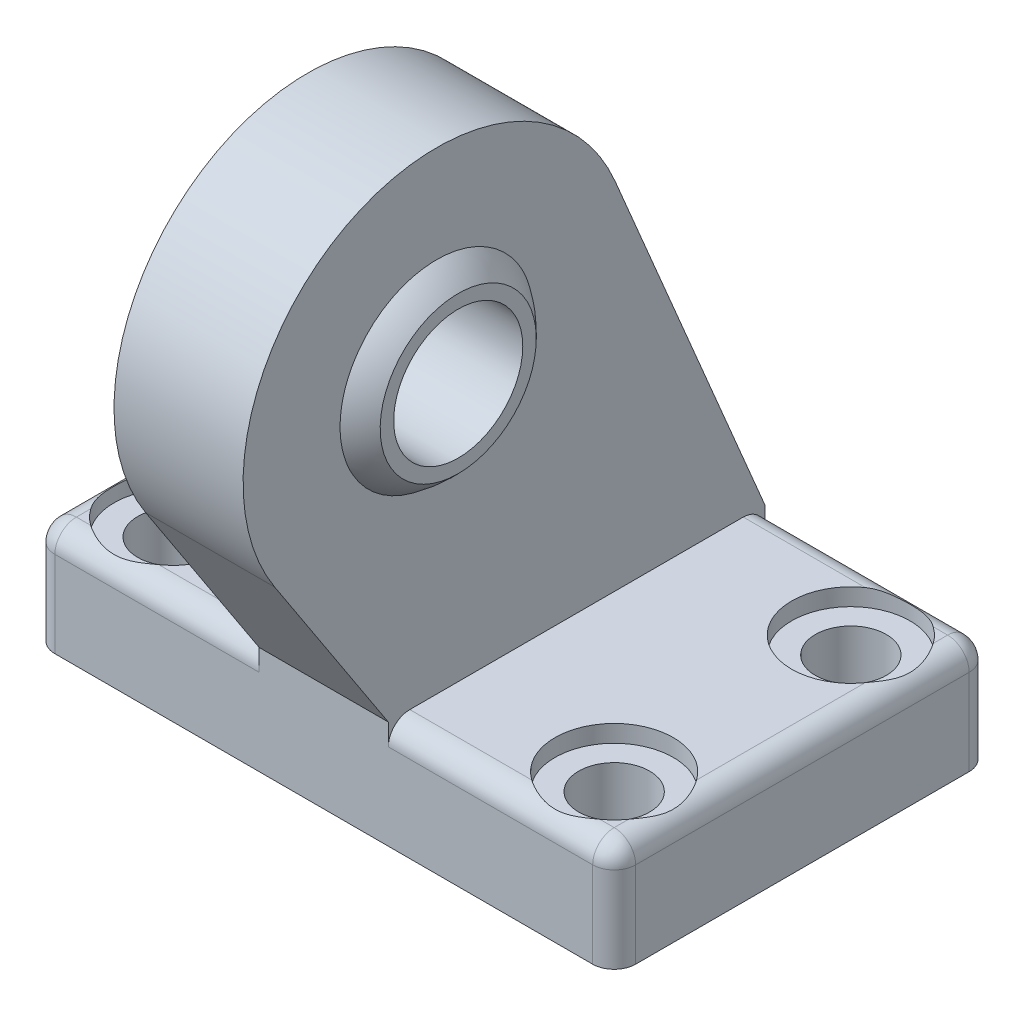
ISO-10303-21;
HEADER;
FILE_DESCRIPTION(('STEP AP214'),'2;1');
FILE_NAME('part.step','',(''),(''),'','','');
FILE_SCHEMA(('AUTOMOTIVE_DESIGN { 1 0 10303 214 1 1 1 1 }'));
ENDSEC;
DATA;
#1=APPLICATION_CONTEXT('core data for automotive mechanical design processes');
#2=APPLICATION_PROTOCOL_DEFINITION('international standard','automotive_design',2000,#1);
#3=PRODUCT_CONTEXT('',#1,'mechanical');
#4=PRODUCT('Part','Part','',(#3));
#5=PRODUCT_RELATED_PRODUCT_CATEGORY('part','',(#4));
#6=PRODUCT_DEFINITION_FORMATION('','',#4);
#7=PRODUCT_DEFINITION_CONTEXT('part definition',#1,'design');
#8=PRODUCT_DEFINITION('design','',#6,#7);
#9=PRODUCT_DEFINITION_SHAPE('','',#8);
#10=(LENGTH_UNIT() NAMED_UNIT(*) SI_UNIT(.MILLI.,.METRE.));
#11=(NAMED_UNIT(*) PLANE_ANGLE_UNIT() SI_UNIT($,.RADIAN.));
#12=(NAMED_UNIT(*) SI_UNIT($,.STERADIAN.) SOLID_ANGLE_UNIT());
#13=UNCERTAINTY_MEASURE_WITH_UNIT(LENGTH_MEASURE(1.E-05),#10,'distance_accuracy_value','');
#14=(GEOMETRIC_REPRESENTATION_CONTEXT(3) GLOBAL_UNCERTAINTY_ASSIGNED_CONTEXT((#13)) GLOBAL_UNIT_ASSIGNED_CONTEXT((#10,
#11,#12)) REPRESENTATION_CONTEXT('',''));
#15=CARTESIAN_POINT('',(0.,0.,0.));
#16=DIRECTION('',(0.,0.,1.));
#17=DIRECTION('',(1.,0.,0.));
#18=AXIS2_PLACEMENT_3D('',#15,#16,#17);
#19=CARTESIAN_POINT('',(-27.000025,36.,-4.5));
#20=DIRECTION('',(1.,0.,0.));
#21=DIRECTION('',(0.,0.,-1.));
#22=AXIS2_PLACEMENT_3D('',#19,#20,#21);
#23=CYLINDRICAL_SURFACE('',#22,6.);
#24=CARTESIAN_POINT('',(-8.,36.,-4.5));
#25=DIRECTION('',(1.,0.,0.));
#26=DIRECTION('',(0.,0.,-1.));
#27=AXIS2_PLACEMENT_3D('',#24,#25,#26);
#28=CIRCLE('',#27,6.);
#29=CARTESIAN_POINT('',(-8.,36.,-10.5));
#30=VERTEX_POINT('',#29);
#31=EDGE_CURVE('E189',#30,#30,#28,.F.);
#32=ORIENTED_EDGE('',*,*,#31,.T.);
#33=EDGE_LOOP('',(#32));
#34=FACE_BOUND('',#33,.T.);
#35=CARTESIAN_POINT('',(8.,36.,-4.5));
#36=DIRECTION('',(1.,0.,0.));
#37=DIRECTION('',(0.,0.,-1.));
#38=AXIS2_PLACEMENT_3D('',#35,#36,#37);
#39=CIRCLE('',#38,6.);
#40=CARTESIAN_POINT('',(8.,36.,-10.5));
#41=VERTEX_POINT('',#40);
#42=EDGE_CURVE('E20',#41,#41,#39,.T.);
#43=ORIENTED_EDGE('',*,*,#42,.T.);
#44=EDGE_LOOP('',(#43));
#45=FACE_BOUND('',#44,.T.);
#46=ADVANCED_FACE('F16',(#34,#45),#23,.F.);
#47=CARTESIAN_POINT('',(27.,10.,0.));
#48=DIRECTION('',(0.,-1.,0.));
#49=DIRECTION('',(0.,0.,-1.));
#50=AXIS2_PLACEMENT_3D('',#47,#48,#49);
#51=PLANE('',#50);
#52=CARTESIAN_POINT('',(-20.5,10.,-6.50000000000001));
#53=DIRECTION('',(0.,1.,0.));
#54=DIRECTION('',(0.,0.,1.));
#55=AXIS2_PLACEMENT_3D('',#52,#53,#54);
#56=CIRCLE('',#55,5.5);
#57=CARTESIAN_POINT('',(-23.6622776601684,10.,-2.));
#58=VERTEX_POINT('',#57);
#59=CARTESIAN_POINT('',(-25.,10.,-3.33772233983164));
#60=VERTEX_POINT('',#59);
#61=EDGE_CURVE('E170',#58,#60,#56,.F.);
#62=ORIENTED_EDGE('',*,*,#61,.T.);
#63=DIRECTION('',(0.,0.,-1.));
#64=VECTOR('',#63,1.);
#65=CARTESIAN_POINT('',(-25.,10.,0.));
#66=LINE('',#65,#64);
#67=CARTESIAN_POINT('',(-25.,10.,-2.));
#68=VERTEX_POINT('',#67);
#69=EDGE_CURVE('E173',#68,#60,#66,.T.);
#70=ORIENTED_EDGE('',*,*,#69,.F.);
#71=DIRECTION('',(1.,0.,0.));
#72=VECTOR('',#71,1.);
#73=CARTESIAN_POINT('',(27.,10.,-2.));
#74=LINE('',#73,#72);
#75=EDGE_CURVE('E157',#58,#68,#74,.F.);
#76=ORIENTED_EDGE('',*,*,#75,.F.);
#77=EDGE_LOOP('',(#62,#70,#76));
#78=FACE_BOUND('',#77,.T.);
#79=ADVANCED_FACE('F169',(#78),#51,.F.);
#80=CARTESIAN_POINT('',(27.,10.,0.));
#81=DIRECTION('',(0.,-1.,0.));
#82=DIRECTION('',(0.,0.,-1.));
#83=AXIS2_PLACEMENT_3D('',#80,#81,#82);
#84=PLANE('',#83);
#85=CARTESIAN_POINT('',(20.5,10.,-6.50000000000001));
#86=DIRECTION('',(0.,1.,0.));
#87=DIRECTION('',(0.,0.,1.));
#88=AXIS2_PLACEMENT_3D('',#85,#86,#87);
#89=CIRCLE('',#88,5.5);
#90=CARTESIAN_POINT('',(25.,10.,-3.33772233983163));
#91=VERTEX_POINT('',#90);
#92=CARTESIAN_POINT('',(23.6622776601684,10.,-2.));
#93=VERTEX_POINT('',#92);
#94=EDGE_CURVE('E179',#91,#93,#89,.F.);
#95=ORIENTED_EDGE('',*,*,#94,.T.);
#96=DIRECTION('',(1.,0.,0.));
#97=VECTOR('',#96,1.);
#98=CARTESIAN_POINT('',(27.,10.,-2.));
#99=LINE('',#98,#97);
#100=CARTESIAN_POINT('',(25.,10.,-1.99999999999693));
#101=VERTEX_POINT('',#100);
#102=EDGE_CURVE('E175',#101,#93,#99,.F.);
#103=ORIENTED_EDGE('',*,*,#102,.F.);
#104=DIRECTION('',(0.,0.,-1.));
#105=VECTOR('',#104,1.);
#106=CARTESIAN_POINT('',(25.,10.,0.));
#107=LINE('',#106,#105);
#108=EDGE_CURVE('E197',#91,#101,#107,.F.);
#109=ORIENTED_EDGE('',*,*,#108,.F.);
#110=EDGE_LOOP('',(#95,#103,#109));
#111=FACE_BOUND('',#110,.T.);
#112=ADVANCED_FACE('F773',(#111),#84,.F.);
#113=CARTESIAN_POINT('',(8.,54.,-35.00005));
#114=DIRECTION('',(-1.,0.,0.));
#115=DIRECTION('',(0.,-1.,0.));
#116=AXIS2_PLACEMENT_3D('',#113,#114,#115);
#117=PLANE('',#116);
#118=CARTESIAN_POINT('',(8.00000000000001,28.7446571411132,-4.5));
#119=CARTESIAN_POINT('',(8.00000000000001,28.7446582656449,-4.29629293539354));
#120=CARTESIAN_POINT('',(8.00000000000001,28.7532434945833,-4.09254894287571));
#121=CARTESIAN_POINT('',(8.,28.7875312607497,-3.68646566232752));
#122=CARTESIAN_POINT('',(8.,28.8132388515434,-3.48412680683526));
#123=CARTESIAN_POINT('',(8.,28.881647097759,-3.08200547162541));
#124=CARTESIAN_POINT('',(8.,28.9243747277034,-2.88222757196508));
#125=CARTESIAN_POINT('',(8.,29.0265604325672,-2.48682528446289));
#126=CARTESIAN_POINT('',(8.,29.0860320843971,-2.29120440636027));
#127=CARTESIAN_POINT('',(8.,29.2211506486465,-1.90600937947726));
#128=CARTESIAN_POINT('',(8.,29.2967695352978,-1.71642539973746));
#129=CARTESIAN_POINT('',(8.,29.4637435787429,-1.34421545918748));
#130=CARTESIAN_POINT('',(8.,29.5551058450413,-1.16159268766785));
#131=CARTESIAN_POINT('',(8.,29.75289694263,-0.804688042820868));
#132=CARTESIAN_POINT('',(8.,29.8593263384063,-0.630406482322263));
#133=CARTESIAN_POINT('',(8.00000000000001,30.0864407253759,-0.291507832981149));
#134=CARTESIAN_POINT('',(8.00000000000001,30.2071192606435,-0.126886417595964));
#135=CARTESIAN_POINT('',(8.00000000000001,30.4619952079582,0.191710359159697));
#136=CARTESIAN_POINT('',(8.00000000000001,30.5962013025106,0.345678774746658));
#137=CARTESIAN_POINT('',(8.,30.8769767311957,0.641614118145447));
#138=CARTESIAN_POINT('',(8.,31.0235340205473,0.783592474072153));
#139=CARTESIAN_POINT('',(8.,31.3281515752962,1.0547666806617));
#140=CARTESIAN_POINT('',(8.,31.4862170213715,1.18395671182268));
#141=CARTESIAN_POINT('',(8.,31.8127064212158,1.42859110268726));
#142=CARTESIAN_POINT('',(8.00000000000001,31.9811327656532,1.54403227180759));
#143=CARTESIAN_POINT('',(8.00000000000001,32.3270853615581,1.76029589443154));
#144=CARTESIAN_POINT('',(8.,32.5046101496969,1.86112068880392));
#145=CARTESIAN_POINT('',(8.,32.8675248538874,2.04745807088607));
#146=CARTESIAN_POINT('',(8.,33.052914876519,2.13297045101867));
#147=CARTESIAN_POINT('',(8.,33.43023535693,2.28807155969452));
#148=CARTESIAN_POINT('',(8.,33.6221656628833,2.35766065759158));
#149=CARTESIAN_POINT('',(8.,34.011208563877,2.48042372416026));
#150=CARTESIAN_POINT('',(8.00000000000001,34.20832121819,2.53359750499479));
#151=CARTESIAN_POINT('',(8.00000000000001,34.6062828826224,2.62314127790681));
#152=CARTESIAN_POINT('',(8.,34.8071310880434,2.65951484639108));
#153=CARTESIAN_POINT('',(8.,35.2112634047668,2.71522826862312));
#154=CARTESIAN_POINT('',(8.,35.4145485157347,2.73456087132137));
#155=CARTESIAN_POINT('',(8.,35.8220247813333,2.75602847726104));
#156=CARTESIAN_POINT('',(8.,36.0262159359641,2.75816348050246));
#157=CARTESIAN_POINT('',(8.,36.4339652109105,2.74522347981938));
#158=CARTESIAN_POINT('',(7.99999999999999,36.6375235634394,2.73015579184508));
#159=CARTESIAN_POINT('',(7.99999999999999,37.0426911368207,2.68292432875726));
#160=CARTESIAN_POINT('',(8.,37.2442999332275,2.65075691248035));
#161=CARTESIAN_POINT('',(8.,37.6440886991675,2.5695528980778));
#162=CARTESIAN_POINT('',(8.,37.8422687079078,2.52051649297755));
#163=CARTESIAN_POINT('',(8.,38.2337979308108,2.40592170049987));
#164=CARTESIAN_POINT('',(8.,38.4271470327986,2.34036292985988));
#165=CARTESIAN_POINT('',(8.,38.8076324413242,2.19319106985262));
#166=CARTESIAN_POINT('',(8.,38.9947688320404,2.11157819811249));
#167=CARTESIAN_POINT('',(8.,39.361530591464,1.93286343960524));
#168=CARTESIAN_POINT('',(8.,39.5411547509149,1.83575907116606));
#169=CARTESIAN_POINT('',(8.,39.8915421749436,1.62678546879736));
#170=CARTESIAN_POINT('',(8.,40.0623074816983,1.5149196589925));
#171=CARTESIAN_POINT('',(8.,40.3937328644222,1.27725493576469));
#172=CARTESIAN_POINT('',(8.,40.554397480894,1.15146235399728));
#173=CARTESIAN_POINT('',(8.,40.8647145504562,0.886668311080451));
#174=CARTESIAN_POINT('',(8.,41.0143562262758,0.747654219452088));
#175=CARTESIAN_POINT('',(8.,41.3012983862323,0.457602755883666));
#176=CARTESIAN_POINT('',(8.,41.4386067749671,0.306573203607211));
#177=CARTESIAN_POINT('',(8.,41.7000743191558,-0.00658484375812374));
#178=CARTESIAN_POINT('',(8.,41.8242275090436,-0.168718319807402));
#179=CARTESIAN_POINT('',(8.,42.0584261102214,-0.502863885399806));
#180=CARTESIAN_POINT('',(8.,42.1684720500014,-0.674875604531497));
#181=CARTESIAN_POINT('',(8.,42.3736324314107,-1.02747989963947));
#182=CARTESIAN_POINT('',(8.00000000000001,42.4687536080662,-1.20806855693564));
#183=CARTESIAN_POINT('',(8.00000000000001,42.6435992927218,-1.57693333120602));
#184=CARTESIAN_POINT('',(8.,42.7232969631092,-1.765222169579));
#185=CARTESIAN_POINT('',(8.,42.8664646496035,-2.1476981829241));
#186=CARTESIAN_POINT('',(8.,42.9299477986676,-2.341880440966));
#187=CARTESIAN_POINT('',(8.,43.040231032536,-2.73458753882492));
#188=CARTESIAN_POINT('',(8.,43.0870574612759,-2.93310498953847));
#189=CARTESIAN_POINT('',(8.00000000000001,43.1638254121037,-3.33333737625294));
#190=CARTESIAN_POINT('',(8.00000000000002,43.1937719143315,-3.53505135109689));
#191=CARTESIAN_POINT('',(8.00000000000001,43.228555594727,-3.8642319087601));
#192=CARTESIAN_POINT('',(8.,43.238597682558,-3.99117116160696));
#193=CARTESIAN_POINT('',(8.,43.2519916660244,-4.24540213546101));
#194=CARTESIAN_POINT('',(8.,43.2553435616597,-4.37269385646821));
#195=CARTESIAN_POINT('',(8.00000000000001,43.2553417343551,-4.70370706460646));
#196=CARTESIAN_POINT('',(8.,43.2467565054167,-4.90745105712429));
#197=CARTESIAN_POINT('',(8.,43.2124687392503,-5.31353433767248));
#198=CARTESIAN_POINT('',(8.,43.1867611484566,-5.51587319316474));
#199=CARTESIAN_POINT('',(8.,43.118352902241,-5.91799452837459));
#200=CARTESIAN_POINT('',(8.,43.0756252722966,-6.11777242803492));
#201=CARTESIAN_POINT('',(8.,42.9734395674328,-6.51317471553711));
#202=CARTESIAN_POINT('',(8.,42.9139679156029,-6.70879559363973));
#203=CARTESIAN_POINT('',(8.,42.7788493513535,-7.09399062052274));
#204=CARTESIAN_POINT('',(8.,42.7032304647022,-7.28357460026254));
#205=CARTESIAN_POINT('',(8.,42.5362564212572,-7.65578454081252));
#206=CARTESIAN_POINT('',(8.,42.4448941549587,-7.83840731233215));
#207=CARTESIAN_POINT('',(8.,42.24710305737,-8.19531195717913));
#208=CARTESIAN_POINT('',(8.,42.1406736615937,-8.36959351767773));
#209=CARTESIAN_POINT('',(8.,41.9135592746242,-8.70849216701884));
#210=CARTESIAN_POINT('',(8.,41.7928807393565,-8.87311358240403));
#211=CARTESIAN_POINT('',(8.,41.5380047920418,-9.1917103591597));
#212=CARTESIAN_POINT('',(8.,41.4037986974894,-9.34567877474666));
#213=CARTESIAN_POINT('',(8.,41.1230232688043,-9.64161411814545));
#214=CARTESIAN_POINT('',(8.,40.9764659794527,-9.78359247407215));
#215=CARTESIAN_POINT('',(8.,40.6718484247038,-10.0547666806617));
#216=CARTESIAN_POINT('',(8.,40.5137829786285,-10.1839567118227));
#217=CARTESIAN_POINT('',(8.,40.1872935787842,-10.4285911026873));
#218=CARTESIAN_POINT('',(8.,40.0188672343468,-10.5440322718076));
#219=CARTESIAN_POINT('',(8.,39.6729146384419,-10.7602958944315));
#220=CARTESIAN_POINT('',(8.,39.4953898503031,-10.8611206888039));
#221=CARTESIAN_POINT('',(8.,39.1324751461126,-11.0474580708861));
#222=CARTESIAN_POINT('',(8.,38.947085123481,-11.1329704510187));
#223=CARTESIAN_POINT('',(8.,38.56976464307,-11.2880715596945));
#224=CARTESIAN_POINT('',(8.,38.3778343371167,-11.3576606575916));
#225=CARTESIAN_POINT('',(8.,37.988791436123,-11.4804237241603));
#226=CARTESIAN_POINT('',(8.,37.79167878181,-11.5335975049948));
#227=CARTESIAN_POINT('',(8.,37.3937171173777,-11.6231412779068));
#228=CARTESIAN_POINT('',(8.,37.1928689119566,-11.6595148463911));
#229=CARTESIAN_POINT('',(8.,36.7887365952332,-11.7152282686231));
#230=CARTESIAN_POINT('',(8.,36.5854514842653,-11.7345608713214));
#231=CARTESIAN_POINT('',(8.,36.1779752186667,-11.756028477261));
#232=CARTESIAN_POINT('',(8.,35.9737840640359,-11.7581634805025));
#233=CARTESIAN_POINT('',(8.,35.5660347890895,-11.7452234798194));
#234=CARTESIAN_POINT('',(8.00000000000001,35.3624764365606,-11.7301557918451));
#235=CARTESIAN_POINT('',(8.00000000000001,34.9573088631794,-11.6829243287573));
#236=CARTESIAN_POINT('',(8.,34.7557000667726,-11.6507569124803));
#237=CARTESIAN_POINT('',(8.,34.3559113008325,-11.5695528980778));
#238=CARTESIAN_POINT('',(8.,34.1577312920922,-11.5205164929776));
#239=CARTESIAN_POINT('',(8.,33.7662020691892,-11.4059217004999));
#240=CARTESIAN_POINT('',(8.,33.5728529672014,-11.3403629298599));
#241=CARTESIAN_POINT('',(8.,33.1923675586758,-11.1931910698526));
#242=CARTESIAN_POINT('',(7.99999999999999,33.0052311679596,-11.1115781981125));
#243=CARTESIAN_POINT('',(7.99999999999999,32.638469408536,-10.9328634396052));
#244=CARTESIAN_POINT('',(8.,32.4588452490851,-10.8357590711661));
#245=CARTESIAN_POINT('',(8.,32.1084578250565,-10.6267854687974));
#246=CARTESIAN_POINT('',(8.,31.9376925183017,-10.5149196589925));
#247=CARTESIAN_POINT('',(8.,31.6062671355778,-10.2772549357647));
#248=CARTESIAN_POINT('',(8.00000000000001,31.445602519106,-10.1514623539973));
#249=CARTESIAN_POINT('',(8.,31.1352854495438,-9.88666831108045));
#250=CARTESIAN_POINT('',(7.99999999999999,30.9856437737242,-9.74765421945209));
#251=CARTESIAN_POINT('',(7.99999999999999,30.6987016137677,-9.45760275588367));
#252=CARTESIAN_POINT('',(8.,30.561393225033,-9.30657320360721));
#253=CARTESIAN_POINT('',(8.00000000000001,30.2999256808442,-8.99341515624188));
#254=CARTESIAN_POINT('',(8.,30.1757724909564,-8.83128168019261));
#255=CARTESIAN_POINT('',(8.,29.9415738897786,-8.4971361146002));
#256=CARTESIAN_POINT('',(8.00000000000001,29.8315279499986,-8.3251243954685));
#257=CARTESIAN_POINT('',(8.,29.6263675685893,-7.97252010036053));
#258=CARTESIAN_POINT('',(8.,29.5312463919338,-7.79193144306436));
#259=CARTESIAN_POINT('',(8.,29.3564007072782,-7.42306666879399));
#260=CARTESIAN_POINT('',(8.,29.2767030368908,-7.23477783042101));
#261=CARTESIAN_POINT('',(8.00000000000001,29.1335353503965,-6.85230181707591));
#262=CARTESIAN_POINT('',(8.00000000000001,29.0700522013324,-6.658119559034));
#263=CARTESIAN_POINT('',(8.,28.959768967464,-6.26541246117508));
#264=CARTESIAN_POINT('',(8.,28.9129425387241,-6.06689501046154));
#265=CARTESIAN_POINT('',(8.00000000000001,28.8361745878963,-5.66666262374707));
#266=CARTESIAN_POINT('',(8.00000000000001,28.8062280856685,-5.46494864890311));
#267=CARTESIAN_POINT('',(8.00000000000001,28.771444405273,-5.1357680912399));
#268=CARTESIAN_POINT('',(8.,28.761402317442,-5.00882883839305));
#269=CARTESIAN_POINT('',(8.,28.7480083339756,-4.75459786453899));
#270=CARTESIAN_POINT('',(8.00000000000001,28.7446564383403,-4.62730614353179));
#271=CARTESIAN_POINT('',(8.00000000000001,28.7446571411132,-4.5));
#272=B_SPLINE_CURVE_WITH_KNOTS('',3,(#118,#119,#120,#121,#122,#123,#124,#125,#126,#127,#128,
#129,#130,#131,#132,#133,#134,#135,#136,#137,#138,#139,#140,#141,#142,#143,#144,#145,#146,#147,
#148,#149,#150,#151,#152,#153,#154,#155,#156,#157,#158,#159,#160,#161,#162,#163,#164,#165,#166,
#167,#168,#169,#170,#171,#172,#173,#174,#175,#176,#177,#178,#179,#180,#181,#182,#183,#184,#185,
#186,#187,#188,#189,#190,#191,#192,#193,#194,#195,#196,#197,#198,#199,#200,#201,#202,#203,#204,
#205,#206,#207,#208,#209,#210,#211,#212,#213,#214,#215,#216,#217,#218,#219,#220,#221,#222,#223,
#224,#225,#226,#227,#228,#229,#230,#231,#232,#233,#234,#235,#236,#237,#238,#239,#240,#241,#242,
#243,#244,#245,#246,#247,#248,#249,#250,#251,#252,#253,#254,#255,#256,#257,#258,#259,#260,#261,
#262,#263,#264,#265,#266,#267,#268,#269,#270,#271),.UNSPECIFIED.,.T.,.F.,(4,2,2,2,2,2,2,2,2,2,2,
2,2,2,2,2,2,2,2,2,2,2,2,2,2,2,2,2,2,2,2,2,2,2,2,2,2,2,2,2,2,2,2,2,2,2,2,2,2,2,2,2,2,2,2,2,2,2,2,
2,2,2,2,2,2,2,2,2,2,2,2,2,2,2,2,2,4),(0.,0.611004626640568,1.22218966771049,1.83434723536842,
2.44700260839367,3.05860315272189,3.67048061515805,4.28238100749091,4.89400521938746,
5.50602452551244,6.11745375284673,6.7291599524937,7.34100783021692,7.95275760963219,
8.56451568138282,9.17625956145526,9.78801044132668,10.3996310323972,11.01151174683,
11.6233924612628,12.2350130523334,12.8467639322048,13.4585078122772,14.0702658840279,
14.6820156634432,15.2938635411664,15.9055697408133,16.5169989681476,17.1290182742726,
17.7406424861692,18.352542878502,18.9644203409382,19.5760208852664,20.1886762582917,
20.8008338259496,21.4120188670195,22.0230234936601,22.4048690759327,22.7867146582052,
23.3977192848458,24.0089043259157,24.6210618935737,25.2337172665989,25.8453178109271,
26.4571952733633,27.0690956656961,27.6807198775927,28.2927391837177,28.904168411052,
29.5158746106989,30.1277224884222,30.7394722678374,31.3512303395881,31.9629742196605,
32.5747250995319,33.1863456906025,33.7982264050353,34.4101071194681,35.0217277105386,
35.63347859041,36.2452224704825,36.8569805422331,37.4687303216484,38.0805781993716,
38.6922843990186,39.3037136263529,39.9157329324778,40.5273571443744,41.1392575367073,
41.7511349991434,42.3627355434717,42.9753909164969,43.5875484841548,44.1987335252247,
44.8097381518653,45.1915837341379,45.5734293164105),.UNSPECIFIED.);
#273=CARTESIAN_POINT('',(8.00000000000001,28.7446571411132,-4.5));
#274=VERTEX_POINT('',#273);
#275=EDGE_CURVE('E183',#274,#274,#272,.T.);
#276=ORIENTED_EDGE('',*,*,#275,.F.);
#277=EDGE_LOOP('',(#276));
#278=FACE_BOUND('',#277,.T.);
#279=ORIENTED_EDGE('',*,*,#42,.F.);
#280=EDGE_LOOP('',(#279));
#281=FACE_BOUND('',#280,.T.);
#282=ADVANCED_FACE('F661',(#278,#281),#117,.F.);
#283=CARTESIAN_POINT('',(-8.,54.,-35.00005));
#284=DIRECTION('',(1.,0.,0.));
#285=DIRECTION('',(0.,1.,0.));
#286=AXIS2_PLACEMENT_3D('',#283,#284,#285);
#287=PLANE('',#286);
#288=CARTESIAN_POINT('',(-8.,43.2553428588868,-4.5));
#289=CARTESIAN_POINT('',(-8.,43.2553417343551,-4.29629293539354));
#290=CARTESIAN_POINT('',(-8.,43.2467565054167,-4.09254894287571));
#291=CARTESIAN_POINT('',(-8.,43.2124687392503,-3.68646566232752));
#292=CARTESIAN_POINT('',(-8.,43.1867611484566,-3.48412680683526));
#293=CARTESIAN_POINT('',(-8.,43.118352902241,-3.08200547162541));
#294=CARTESIAN_POINT('',(-8.,43.0756252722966,-2.88222757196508));
#295=CARTESIAN_POINT('',(-8.,42.9734395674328,-2.48682528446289));
#296=CARTESIAN_POINT('',(-8.,42.9139679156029,-2.29120440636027));
#297=CARTESIAN_POINT('',(-8.,42.7788493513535,-1.90600937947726));
#298=CARTESIAN_POINT('',(-8.,42.7032304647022,-1.71642539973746));
#299=CARTESIAN_POINT('',(-8.,42.5362564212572,-1.34421545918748));
#300=CARTESIAN_POINT('',(-8.,42.4448941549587,-1.16159268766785));
#301=CARTESIAN_POINT('',(-8.,42.24710305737,-0.804688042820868));
#302=CARTESIAN_POINT('',(-8.,42.1406736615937,-0.630406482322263));
#303=CARTESIAN_POINT('',(-8.,41.9135592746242,-0.291507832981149));
#304=CARTESIAN_POINT('',(-8.00000000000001,41.7928807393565,-0.126886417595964));
#305=CARTESIAN_POINT('',(-8.00000000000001,41.5380047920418,0.191710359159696));
#306=CARTESIAN_POINT('',(-8.,41.4037986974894,0.345678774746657));
#307=CARTESIAN_POINT('',(-8.,41.1230232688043,0.641614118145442));
#308=CARTESIAN_POINT('',(-8.,40.9764659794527,0.783592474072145));
#309=CARTESIAN_POINT('',(-8.,40.6718484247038,1.05476668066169));
#310=CARTESIAN_POINT('',(-8.,40.5137829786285,1.18395671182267));
#311=CARTESIAN_POINT('',(-8.,40.1872935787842,1.42859110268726));
#312=CARTESIAN_POINT('',(-8.,40.0188672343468,1.54403227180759));
#313=CARTESIAN_POINT('',(-8.,39.6729146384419,1.76029589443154));
#314=CARTESIAN_POINT('',(-8.,39.4953898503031,1.86112068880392));
#315=CARTESIAN_POINT('',(-8.,39.1324751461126,2.04745807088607));
#316=CARTESIAN_POINT('',(-8.,38.947085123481,2.13297045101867));
#317=CARTESIAN_POINT('',(-8.,38.56976464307,2.28807155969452));
#318=CARTESIAN_POINT('',(-8.,38.3778343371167,2.35766065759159));
#319=CARTESIAN_POINT('',(-8.,37.988791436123,2.48042372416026));
#320=CARTESIAN_POINT('',(-8.00000000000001,37.79167878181,2.5335975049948));
#321=CARTESIAN_POINT('',(-8.00000000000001,37.3937171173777,2.62314127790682));
#322=CARTESIAN_POINT('',(-8.,37.1928689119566,2.65951484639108));
#323=CARTESIAN_POINT('',(-8.,36.7887365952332,2.71522826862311));
#324=CARTESIAN_POINT('',(-8.,36.5854514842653,2.73456087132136));
#325=CARTESIAN_POINT('',(-8.,36.1779752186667,2.75602847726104));
#326=CARTESIAN_POINT('',(-8.,35.9737840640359,2.75816348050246));
#327=CARTESIAN_POINT('',(-8.,35.5660347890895,2.74522347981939));
#328=CARTESIAN_POINT('',(-8.00000000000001,35.3624764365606,2.73015579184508));
#329=CARTESIAN_POINT('',(-8.00000000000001,34.9573088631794,2.68292432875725));
#330=CARTESIAN_POINT('',(-8.,34.7557000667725,2.65075691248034));
#331=CARTESIAN_POINT('',(-8.,34.3559113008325,2.56955289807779));
#332=CARTESIAN_POINT('',(-8.,34.1577312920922,2.52051649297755));
#333=CARTESIAN_POINT('',(-8.,33.7662020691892,2.40592170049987));
#334=CARTESIAN_POINT('',(-8.,33.5728529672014,2.34036292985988));
#335=CARTESIAN_POINT('',(-8.,33.1923675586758,2.19319106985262));
#336=CARTESIAN_POINT('',(-8.00000000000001,33.0052311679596,2.11157819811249));
#337=CARTESIAN_POINT('',(-8.00000000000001,32.638469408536,1.93286343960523));
#338=CARTESIAN_POINT('',(-8.,32.4588452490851,1.83575907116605));
#339=CARTESIAN_POINT('',(-8.,32.1084578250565,1.62678546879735));
#340=CARTESIAN_POINT('',(-8.,31.9376925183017,1.5149196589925));
#341=CARTESIAN_POINT('',(-8.00000000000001,31.6062671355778,1.2772549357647));
#342=CARTESIAN_POINT('',(-8.00000000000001,31.445602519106,1.15146235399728));
#343=CARTESIAN_POINT('',(-8.,31.1352854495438,0.88666831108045));
#344=CARTESIAN_POINT('',(-8.,30.9856437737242,0.747654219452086));
#345=CARTESIAN_POINT('',(-8.,30.6987016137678,0.457602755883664));
#346=CARTESIAN_POINT('',(-8.,30.561393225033,0.306573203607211));
#347=CARTESIAN_POINT('',(-8.00000000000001,30.2999256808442,-0.00658484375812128));
#348=CARTESIAN_POINT('',(-8.,30.1757724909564,-0.168718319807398));
#349=CARTESIAN_POINT('',(-8.,29.9415738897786,-0.502863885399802));
#350=CARTESIAN_POINT('',(-8.,29.8315279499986,-0.674875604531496));
#351=CARTESIAN_POINT('',(-8.00000000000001,29.6263675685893,-1.02747989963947));
#352=CARTESIAN_POINT('',(-8.00000000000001,29.5312463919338,-1.20806855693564));
#353=CARTESIAN_POINT('',(-8.00000000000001,29.3564007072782,-1.57693333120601));
#354=CARTESIAN_POINT('',(-8.,29.2767030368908,-1.765222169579));
#355=CARTESIAN_POINT('',(-8.,29.1335353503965,-2.14769818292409));
#356=CARTESIAN_POINT('',(-8.,29.0700522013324,-2.341880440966));
#357=CARTESIAN_POINT('',(-8.,28.959768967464,-2.73458753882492));
#358=CARTESIAN_POINT('',(-8.,28.9129425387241,-2.93310498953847));
#359=CARTESIAN_POINT('',(-8.00000000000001,28.8361745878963,-3.33333737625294));
#360=CARTESIAN_POINT('',(-8.00000000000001,28.8062280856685,-3.53505135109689));
#361=CARTESIAN_POINT('',(-8.00000000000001,28.771444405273,-3.8642319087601));
#362=CARTESIAN_POINT('',(-8.00000000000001,28.761402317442,-3.99117116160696));
#363=CARTESIAN_POINT('',(-8.,28.7480083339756,-4.24540213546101));
#364=CARTESIAN_POINT('',(-8.,28.7446564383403,-4.37269385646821));
#365=CARTESIAN_POINT('',(-8.,28.7446582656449,-4.70370706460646));
#366=CARTESIAN_POINT('',(-8.,28.7532434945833,-4.90745105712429));
#367=CARTESIAN_POINT('',(-8.00000000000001,28.7875312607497,-5.31353433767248));
#368=CARTESIAN_POINT('',(-8.,28.8132388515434,-5.51587319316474));
#369=CARTESIAN_POINT('',(-8.,28.881647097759,-5.91799452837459));
#370=CARTESIAN_POINT('',(-8.,28.9243747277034,-6.11777242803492));
#371=CARTESIAN_POINT('',(-8.,29.0265604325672,-6.51317471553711));
#372=CARTESIAN_POINT('',(-8.,29.0860320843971,-6.70879559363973));
#373=CARTESIAN_POINT('',(-8.,29.2211506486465,-7.09399062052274));
#374=CARTESIAN_POINT('',(-8.,29.2967695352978,-7.28357460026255));
#375=CARTESIAN_POINT('',(-8.,29.4637435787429,-7.65578454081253));
#376=CARTESIAN_POINT('',(-8.,29.5551058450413,-7.83840731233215));
#377=CARTESIAN_POINT('',(-8.,29.75289694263,-8.19531195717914));
#378=CARTESIAN_POINT('',(-8.,29.8593263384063,-8.36959351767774));
#379=CARTESIAN_POINT('',(-8.00000000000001,30.0864407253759,-8.70849216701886));
#380=CARTESIAN_POINT('',(-8.00000000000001,30.2071192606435,-8.87311358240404));
#381=CARTESIAN_POINT('',(-8.00000000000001,30.4619952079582,-9.1917103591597));
#382=CARTESIAN_POINT('',(-8.00000000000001,30.5962013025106,-9.34567877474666));
#383=CARTESIAN_POINT('',(-8.,30.8769767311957,-9.64161411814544));
#384=CARTESIAN_POINT('',(-8.,31.0235340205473,-9.78359247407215));
#385=CARTESIAN_POINT('',(-8.,31.3281515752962,-10.0547666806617));
#386=CARTESIAN_POINT('',(-8.,31.4862170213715,-10.1839567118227));
#387=CARTESIAN_POINT('',(-8.,31.8127064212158,-10.4285911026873));
#388=CARTESIAN_POINT('',(-8.,31.9811327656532,-10.5440322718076));
#389=CARTESIAN_POINT('',(-8.,32.3270853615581,-10.7602958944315));
#390=CARTESIAN_POINT('',(-8.,32.5046101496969,-10.8611206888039));
#391=CARTESIAN_POINT('',(-8.,32.8675248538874,-11.0474580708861));
#392=CARTESIAN_POINT('',(-8.,33.052914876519,-11.1329704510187));
#393=CARTESIAN_POINT('',(-8.,33.43023535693,-11.2880715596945));
#394=CARTESIAN_POINT('',(-8.,33.6221656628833,-11.3576606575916));
#395=CARTESIAN_POINT('',(-8.,34.0112085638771,-11.4804237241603));
#396=CARTESIAN_POINT('',(-8.00000000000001,34.20832121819,-11.5335975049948));
#397=CARTESIAN_POINT('',(-8.00000000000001,34.6062828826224,-11.6231412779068));
#398=CARTESIAN_POINT('',(-8.,34.8071310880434,-11.6595148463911));
#399=CARTESIAN_POINT('',(-8.,35.2112634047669,-11.7152282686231));
#400=CARTESIAN_POINT('',(-8.,35.4145485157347,-11.7345608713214));
#401=CARTESIAN_POINT('',(-8.,35.8220247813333,-11.756028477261));
#402=CARTESIAN_POINT('',(-8.,36.0262159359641,-11.7581634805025));
#403=CARTESIAN_POINT('',(-8.,36.4339652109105,-11.7452234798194));
#404=CARTESIAN_POINT('',(-7.99999999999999,36.6375235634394,-11.7301557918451));
#405=CARTESIAN_POINT('',(-7.99999999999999,37.0426911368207,-11.6829243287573));
#406=CARTESIAN_POINT('',(-8.,37.2442999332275,-11.6507569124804));
#407=CARTESIAN_POINT('',(-8.,37.6440886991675,-11.5695528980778));
#408=CARTESIAN_POINT('',(-8.,37.8422687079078,-11.5205164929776));
#409=CARTESIAN_POINT('',(-8.,38.2337979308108,-11.4059217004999));
#410=CARTESIAN_POINT('',(-8.,38.4271470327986,-11.3403629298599));
#411=CARTESIAN_POINT('',(-8.,38.8076324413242,-11.1931910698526));
#412=CARTESIAN_POINT('',(-8.00000000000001,38.9947688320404,-11.1115781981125));
#413=CARTESIAN_POINT('',(-8.00000000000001,39.361530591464,-10.9328634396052));
#414=CARTESIAN_POINT('',(-8.,39.5411547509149,-10.8357590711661));
#415=CARTESIAN_POINT('',(-8.,39.8915421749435,-10.6267854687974));
#416=CARTESIAN_POINT('',(-8.,40.0623074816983,-10.5149196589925));
#417=CARTESIAN_POINT('',(-8.,40.3937328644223,-10.2772549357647));
#418=CARTESIAN_POINT('',(-8.,40.554397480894,-10.1514623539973));
#419=CARTESIAN_POINT('',(-8.,40.8647145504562,-9.88666831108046));
#420=CARTESIAN_POINT('',(-8.,41.0143562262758,-9.74765421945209));
#421=CARTESIAN_POINT('',(-8.,41.3012983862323,-9.45760275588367));
#422=CARTESIAN_POINT('',(-8.,41.4386067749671,-9.30657320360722));
#423=CARTESIAN_POINT('',(-8.,41.7000743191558,-8.99341515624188));
#424=CARTESIAN_POINT('',(-8.,41.8242275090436,-8.8312816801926));
#425=CARTESIAN_POINT('',(-8.,42.0584261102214,-8.4971361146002));
#426=CARTESIAN_POINT('',(-8.,42.1684720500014,-8.3251243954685));
#427=CARTESIAN_POINT('',(-8.,42.3736324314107,-7.97252010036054));
#428=CARTESIAN_POINT('',(-8.00000000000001,42.4687536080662,-7.79193144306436));
#429=CARTESIAN_POINT('',(-8.00000000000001,42.6435992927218,-7.42306666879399));
#430=CARTESIAN_POINT('',(-8.,42.7232969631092,-7.23477783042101));
#431=CARTESIAN_POINT('',(-8.,42.8664646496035,-6.85230181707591));
#432=CARTESIAN_POINT('',(-8.,42.9299477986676,-6.658119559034));
#433=CARTESIAN_POINT('',(-8.,43.040231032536,-6.26541246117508));
#434=CARTESIAN_POINT('',(-8.,43.0870574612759,-6.06689501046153));
#435=CARTESIAN_POINT('',(-8.,43.1638254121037,-5.66666262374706));
#436=CARTESIAN_POINT('',(-8.00000000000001,43.1937719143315,-5.46494864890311));
#437=CARTESIAN_POINT('',(-8.00000000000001,43.228555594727,-5.1357680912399));
#438=CARTESIAN_POINT('',(-8.,43.238597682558,-5.00882883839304));
#439=CARTESIAN_POINT('',(-8.,43.2519916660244,-4.75459786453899));
#440=CARTESIAN_POINT('',(-8.,43.2553435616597,-4.62730614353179));
#441=CARTESIAN_POINT('',(-8.,43.2553428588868,-4.5));
#442=B_SPLINE_CURVE_WITH_KNOTS('',3,(#288,#289,#290,#291,#292,#293,#294,#295,#296,#297,#298,
#299,#300,#301,#302,#303,#304,#305,#306,#307,#308,#309,#310,#311,#312,#313,#314,#315,#316,#317,
#318,#319,#320,#321,#322,#323,#324,#325,#326,#327,#328,#329,#330,#331,#332,#333,#334,#335,#336,
#337,#338,#339,#340,#341,#342,#343,#344,#345,#346,#347,#348,#349,#350,#351,#352,#353,#354,#355,
#356,#357,#358,#359,#360,#361,#362,#363,#364,#365,#366,#367,#368,#369,#370,#371,#372,#373,#374,
#375,#376,#377,#378,#379,#380,#381,#382,#383,#384,#385,#386,#387,#388,#389,#390,#391,#392,#393,
#394,#395,#396,#397,#398,#399,#400,#401,#402,#403,#404,#405,#406,#407,#408,#409,#410,#411,#412,
#413,#414,#415,#416,#417,#418,#419,#420,#421,#422,#423,#424,#425,#426,#427,#428,#429,#430,#431,
#432,#433,#434,#435,#436,#437,#438,#439,#440,#441),.UNSPECIFIED.,.T.,.F.,(4,2,2,2,2,2,2,2,2,2,2,
2,2,2,2,2,2,2,2,2,2,2,2,2,2,2,2,2,2,2,2,2,2,2,2,2,2,2,2,2,2,2,2,2,2,2,2,2,2,2,2,2,2,2,2,2,2,2,2,
2,2,2,2,2,2,2,2,2,2,2,2,2,2,2,2,2,4),(0.,0.611004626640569,1.22218966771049,1.83434723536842,
2.44700260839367,3.05860315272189,3.67048061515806,4.2823810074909,4.89400521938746,
5.50602452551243,6.11745375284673,6.7291599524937,7.34100783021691,7.9527576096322,
8.56451568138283,9.17625956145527,9.78801044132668,10.3996310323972,11.01151174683,
11.6233924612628,12.2350130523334,12.8467639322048,13.4585078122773,14.0702658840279,
14.6820156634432,15.2938635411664,15.9055697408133,16.5169989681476,17.1290182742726,
17.7406424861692,18.352542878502,18.9644203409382,19.5760208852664,20.1886762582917,
20.8008338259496,21.4120188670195,22.0230234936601,22.4048690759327,22.7867146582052,
23.3977192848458,24.0089043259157,24.6210618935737,25.2337172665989,25.8453178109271,
26.4571952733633,27.0690956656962,27.6807198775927,28.2927391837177,28.904168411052,
29.5158746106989,30.1277224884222,30.7394722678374,31.3512303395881,31.9629742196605,
32.5747250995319,33.1863456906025,33.7982264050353,34.4101071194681,35.0217277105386,
35.6334785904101,36.2452224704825,36.8569805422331,37.4687303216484,38.0805781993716,
38.6922843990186,39.3037136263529,39.9157329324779,40.5273571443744,41.1392575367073,
41.7511349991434,42.3627355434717,42.9753909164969,43.5875484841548,44.1987335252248,
44.8097381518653,45.1915837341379,45.5734293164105),.UNSPECIFIED.);
#443=CARTESIAN_POINT('',(-8.,43.2553428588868,-4.5));
#444=VERTEX_POINT('',#443);
#445=EDGE_CURVE('E651',#444,#444,#442,.T.);
#446=ORIENTED_EDGE('',*,*,#445,.F.);
#447=EDGE_LOOP('',(#446));
#448=FACE_BOUND('',#447,.T.);
#449=ORIENTED_EDGE('',*,*,#31,.F.);
#450=EDGE_LOOP('',(#449));
#451=FACE_BOUND('',#450,.T.);
#452=ADVANCED_FACE('F656',(#448,#451),#287,.F.);
#453=CARTESIAN_POINT('',(27.,10.,0.));
#454=DIRECTION('',(0.,-1.,0.));
#455=DIRECTION('',(0.,0.,-1.));
#456=AXIS2_PLACEMENT_3D('',#453,#454,#455);
#457=PLANE('',#456);
#458=CARTESIAN_POINT('',(-20.5,10.,-28.5));
#459=DIRECTION('',(0.,1.,0.));
#460=DIRECTION('',(0.,0.,1.));
#461=AXIS2_PLACEMENT_3D('',#458,#459,#460);
#462=CIRCLE('',#461,5.49999999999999);
#463=CARTESIAN_POINT('',(-25.,10.,-31.6622776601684));
#464=VERTEX_POINT('',#463);
#465=CARTESIAN_POINT('',(-23.6622776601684,10.,-33.));
#466=VERTEX_POINT('',#465);
#467=EDGE_CURVE('E645',#464,#466,#462,.F.);
#468=ORIENTED_EDGE('',*,*,#467,.T.);
#469=DIRECTION('',(1.,0.,0.));
#470=VECTOR('',#469,1.);
#471=CARTESIAN_POINT('',(27.,10.,-33.));
#472=LINE('',#471,#470);
#473=CARTESIAN_POINT('',(-25.,10.,-33.));
#474=VERTEX_POINT('',#473);
#475=EDGE_CURVE('E191',#474,#466,#472,.T.);
#476=ORIENTED_EDGE('',*,*,#475,.F.);
#477=DIRECTION('',(0.,0.,-1.));
#478=VECTOR('',#477,1.);
#479=CARTESIAN_POINT('',(-25.,10.,0.));
#480=LINE('',#479,#478);
#481=EDGE_CURVE('E194',#464,#474,#480,.T.);
#482=ORIENTED_EDGE('',*,*,#481,.F.);
#483=EDGE_LOOP('',(#468,#476,#482));
#484=FACE_BOUND('',#483,.T.);
#485=ADVANCED_FACE('F660',(#484),#457,.F.);
#486=CARTESIAN_POINT('',(27.,10.,0.));
#487=DIRECTION('',(0.,-1.,0.));
#488=DIRECTION('',(0.,0.,-1.));
#489=AXIS2_PLACEMENT_3D('',#486,#487,#488);
#490=PLANE('',#489);
#491=CARTESIAN_POINT('',(20.5,10.,-28.5));
#492=DIRECTION('',(0.,1.,0.));
#493=DIRECTION('',(0.,0.,1.));
#494=AXIS2_PLACEMENT_3D('',#491,#492,#493);
#495=CIRCLE('',#494,5.5);
#496=CARTESIAN_POINT('',(23.6622776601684,10.,-33.));
#497=VERTEX_POINT('',#496);
#498=CARTESIAN_POINT('',(25.,10.,-31.6622776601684));
#499=VERTEX_POINT('',#498);
#500=EDGE_CURVE('E642',#497,#499,#495,.F.);
#501=ORIENTED_EDGE('',*,*,#500,.T.);
#502=DIRECTION('',(0.,0.,-1.));
#503=VECTOR('',#502,1.);
#504=CARTESIAN_POINT('',(25.,10.,0.));
#505=LINE('',#504,#503);
#506=CARTESIAN_POINT('',(25.,10.,-33.));
#507=VERTEX_POINT('',#506);
#508=EDGE_CURVE('E186',#507,#499,#505,.F.);
#509=ORIENTED_EDGE('',*,*,#508,.F.);
#510=DIRECTION('',(1.,0.,0.));
#511=VECTOR('',#510,1.);
#512=CARTESIAN_POINT('',(27.,10.,-33.));
#513=LINE('',#512,#511);
#514=EDGE_CURVE('E180',#497,#507,#513,.T.);
#515=ORIENTED_EDGE('',*,*,#514,.F.);
#516=EDGE_LOOP('',(#501,#509,#515));
#517=FACE_BOUND('',#516,.T.);
#518=ADVANCED_FACE('F667',(#517),#490,.F.);
#519=CARTESIAN_POINT('',(-20.5,8.4,-6.50000000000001));
#520=DIRECTION('',(0.,1.,0.));
#521=DIRECTION('',(0.,0.,1.));
#522=AXIS2_PLACEMENT_3D('',#519,#520,#521);
#523=CYLINDRICAL_SURFACE('',#522,5.5);
#524=CARTESIAN_POINT('',(-20.5,8.4,-6.50000000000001));
#525=DIRECTION('',(0.,1.,0.));
#526=DIRECTION('',(0.,0.,1.));
#527=AXIS2_PLACEMENT_3D('',#524,#525,#526);
#528=CIRCLE('',#527,5.5);
#529=CARTESIAN_POINT('',(-20.5,8.4,-1.00000000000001));
#530=VERTEX_POINT('',#529);
#531=EDGE_CURVE('E633',#530,#530,#528,.T.);
#532=ORIENTED_EDGE('',*,*,#531,.F.);
#533=EDGE_LOOP('',(#532));
#534=FACE_BOUND('',#533,.T.);
#535=ORIENTED_EDGE('',*,*,#61,.F.);
#536=CARTESIAN_POINT('',(-17.3377223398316,10.,-2.));
#537=CARTESIAN_POINT('',(-17.4467424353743,9.99995273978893,-1.92337219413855));
#538=CARTESIAN_POINT('',(-17.5584494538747,9.99560129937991,-1.85080659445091));
#539=CARTESIAN_POINT('',(-17.7863650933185,9.98067722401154,-1.71421181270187));
#540=CARTESIAN_POINT('',(-17.9025668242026,9.97011378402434,-1.65017018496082));
#541=CARTESIAN_POINT('',(-18.1394902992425,9.94507904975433,-1.53052214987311));
#542=CARTESIAN_POINT('',(-18.2602309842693,9.93058932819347,-1.47495750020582));
#543=CARTESIAN_POINT('',(-18.5052724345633,9.89984439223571,-1.37275021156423));
#544=CARTESIAN_POINT('',(-18.6295748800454,9.88358833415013,-1.32611186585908));
#545=CARTESIAN_POINT('',(-18.8954807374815,9.84949095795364,-1.23717475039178));
#546=CARTESIAN_POINT('',(-19.0374523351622,9.83167800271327,-1.1959613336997));
#547=CARTESIAN_POINT('',(-19.3245590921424,9.79888158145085,-1.12503982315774));
#548=CARTESIAN_POINT('',(-19.4696939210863,9.78389782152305,-1.09533053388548));
#549=CARTESIAN_POINT('',(-19.7617376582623,9.7589740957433,-1.04777459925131));
#550=CARTESIAN_POINT('',(-19.9086370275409,9.74901399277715,-1.029880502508));
#551=CARTESIAN_POINT('',(-20.2036930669,9.73555370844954,-1.00599426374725));
#552=CARTESIAN_POINT('',(-20.3518495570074,9.73205261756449,-1.00000044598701));
#553=CARTESIAN_POINT('',(-20.6379524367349,9.73204912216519,-0.999999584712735));
#554=CARTESIAN_POINT('',(-20.775899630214,9.73508154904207,-1.00519582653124));
#555=CARTESIAN_POINT('',(-21.0507666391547,9.74679419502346,-1.02591075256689));
#556=CARTESIAN_POINT('',(-21.1876864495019,9.75547444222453,-1.041429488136));
#557=CARTESIAN_POINT('',(-21.460133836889,9.77738382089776,-1.08269405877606));
#558=CARTESIAN_POINT('',(-21.5956540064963,9.79063036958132,-1.10847911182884));
#559=CARTESIAN_POINT('',(-21.8640874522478,9.81999017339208,-1.1700624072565));
#560=CARTESIAN_POINT('',(-21.9970003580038,9.83610383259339,-1.20586206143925));
#561=CARTESIAN_POINT('',(-22.2647922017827,9.86985883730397,-1.28886602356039));
#562=CARTESIAN_POINT('',(-22.3995458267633,9.88753524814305,-1.33646048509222));
#563=CARTESIAN_POINT('',(-22.6650531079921,9.92139385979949,-1.44204082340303));
#564=CARTESIAN_POINT('',(-22.7958082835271,9.93757663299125,-1.50002269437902));
#565=CARTESIAN_POINT('',(-23.0522669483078,9.96576786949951,-1.62596256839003));
#566=CARTESIAN_POINT('',(-23.1779892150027,9.97779344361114,-1.69387800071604));
#567=CARTESIAN_POINT('',(-23.3626505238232,9.99062759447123,-1.80315408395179));
#568=CARTESIAN_POINT('',(-23.4235984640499,9.99403892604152,-1.84084686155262));
#569=CARTESIAN_POINT('',(-23.5440542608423,9.99872358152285,-1.91863794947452));
#570=CARTESIAN_POINT('',(-23.6035615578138,9.99999608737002,-1.95873717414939));
#571=CARTESIAN_POINT('',(-23.6622776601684,10.0000000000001,-1.99999999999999));
#572=B_SPLINE_CURVE_WITH_KNOTS('',3,(#536,#537,#538,#539,#540,#541,#542,#543,#544,#545,#546,
#547,#548,#549,#550,#551,#552,#553,#554,#555,#556,#557,#558,#559,#560,#561,#562,#563,#564,#565,
#566,#567,#568,#569,#570,#571),.UNSPECIFIED.,.F.,.F.,(4,2,2,2,2,2,2,2,2,2,2,2,2,2,2,2,2,4),(0.,
0.39941879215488,0.79824784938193,1.19898216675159,1.59990874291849,2.04612536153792,
2.49229560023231,2.93666288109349,3.38096758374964,3.79468836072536,4.20841119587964,
4.62372987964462,5.03910714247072,5.47067560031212,5.90207798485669,6.33168298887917,
6.54683489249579,6.76206906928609),.UNSPECIFIED.);
#573=CARTESIAN_POINT('',(-17.3377223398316,10.,-2.));
#574=VERTEX_POINT('',#573);
#575=EDGE_CURVE('E152',#574,#58,#572,.T.);
#576=ORIENTED_EDGE('',*,*,#575,.F.);
#577=CARTESIAN_POINT('',(-20.5,10.,-6.50000000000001));
#578=DIRECTION('',(0.,1.,0.));
#579=DIRECTION('',(0.,0.,1.));
#580=AXIS2_PLACEMENT_3D('',#577,#578,#579);
#581=CIRCLE('',#580,5.5);
#582=CARTESIAN_POINT('',(-25.,10.,-9.66227766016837));
#583=VERTEX_POINT('',#582);
#584=EDGE_CURVE('E650',#574,#583,#581,.T.);
#585=ORIENTED_EDGE('',*,*,#584,.T.);
#586=CARTESIAN_POINT('',(-25.,10.,-3.33772233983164));
#587=CARTESIAN_POINT('',(-25.0766478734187,9.99995268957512,-3.44677090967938));
#588=CARTESIAN_POINT('',(-25.1492314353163,9.99559899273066,-3.55850795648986));
#589=CARTESIAN_POINT('',(-25.2858604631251,9.98066746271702,-3.78649062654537));
#590=CARTESIAN_POINT('',(-25.3499180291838,9.97009856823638,-3.90272955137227));
#591=CARTESIAN_POINT('',(-25.4695586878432,9.94505888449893,-4.13966240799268));
#592=CARTESIAN_POINT('',(-25.5251049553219,9.93057185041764,-4.26037303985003));
#593=CARTESIAN_POINT('',(-25.6272782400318,9.8998345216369,-4.5053483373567));
#594=CARTESIAN_POINT('',(-25.6739013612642,9.88358346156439,-4.6296145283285));
#595=CARTESIAN_POINT('',(-25.7607578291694,9.85028336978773,-4.88929941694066));
#596=CARTESIAN_POINT('',(-25.8003890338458,9.83325006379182,-5.0249220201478));
#597=CARTESIAN_POINT('',(-25.8691500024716,9.80166938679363,-5.29908531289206));
#598=CARTESIAN_POINT('',(-25.8982808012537,9.78712177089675,-5.43762571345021));
#599=CARTESIAN_POINT('',(-25.9457240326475,9.76247625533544,-5.71641667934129));
#600=CARTESIAN_POINT('',(-25.9640767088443,9.75236183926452,-5.85665886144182));
#601=CARTESIAN_POINT('',(-25.9899259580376,9.73789224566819,-6.13844036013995));
#602=CARTESIAN_POINT('',(-25.9974232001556,9.73353671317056,-6.27997959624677));
#603=CARTESIAN_POINT('',(-26.0015172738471,9.73117642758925,-6.56729687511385));
#604=CARTESIAN_POINT('',(-25.9977984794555,9.73335555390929,-6.71308113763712));
#605=CARTESIAN_POINT('',(-25.9788261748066,9.74413707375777,-7.00365535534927));
#606=CARTESIAN_POINT('',(-25.9635717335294,9.75273998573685,-7.14844522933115));
#607=CARTESIAN_POINT('',(-25.921638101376,9.77514661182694,-7.43654917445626));
#608=CARTESIAN_POINT('',(-25.8949117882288,9.78897174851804,-7.57985463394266));
#609=CARTESIAN_POINT('',(-25.8302774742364,9.81986767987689,-7.86356822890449));
#610=CARTESIAN_POINT('',(-25.7923678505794,9.83693894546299,-8.00397594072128));
#611=CARTESIAN_POINT('',(-25.7066764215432,9.87154696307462,-8.2778044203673));
#612=CARTESIAN_POINT('',(-25.6591628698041,9.88906165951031,-8.41131210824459));
#613=CARTESIAN_POINT('',(-25.5539254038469,9.92255438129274,-8.67437362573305));
#614=CARTESIAN_POINT('',(-25.4962060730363,9.93853309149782,-8.80392919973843));
#615=CARTESIAN_POINT('',(-25.3710054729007,9.96632852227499,-9.05797751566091));
#616=CARTESIAN_POINT('',(-25.3035722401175,9.97816479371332,-9.18249151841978));
#617=CARTESIAN_POINT('',(-25.1951539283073,9.99078884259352,-9.36540872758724));
#618=CARTESIAN_POINT('',(-25.1577689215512,9.99414244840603,-9.42578748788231));
#619=CARTESIAN_POINT('',(-25.0806373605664,9.99874653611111,-9.54512947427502));
#620=CARTESIAN_POINT('',(-25.040889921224,9.99999622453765,-9.60409215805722));
#621=CARTESIAN_POINT('',(-25.,10.,-9.66227766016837));
#622=B_SPLINE_CURVE_WITH_KNOTS('',3,(#586,#587,#588,#589,#590,#591,#592,#593,#594,#595,#596,
#597,#598,#599,#600,#601,#602,#603,#604,#605,#606,#607,#608,#609,#610,#611,#612,#613,#614,#615,
#616,#617,#618,#619,#620,#621),.UNSPECIFIED.,.F.,.F.,(4,2,2,2,2,2,2,2,2,2,2,2,2,2,2,2,2,4),(0.,
0.399523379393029,0.798473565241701,1.19910387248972,1.59990870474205,2.02643726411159,
2.45292377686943,2.87780757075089,3.30266517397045,3.73958900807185,4.1765481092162,
4.61531951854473,5.05415462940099,5.48210261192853,5.90985888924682,6.3355681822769,
6.54877812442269,6.76206845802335),.UNSPECIFIED.);
#623=EDGE_CURVE('E178',#60,#583,#622,.T.);
#624=ORIENTED_EDGE('',*,*,#623,.F.);
#625=EDGE_LOOP('',(#535,#576,#585,#624));
#626=FACE_BOUND('',#625,.T.);
#627=ADVANCED_FACE('F177',(#534,#626),#523,.F.);
#628=CARTESIAN_POINT('',(20.5,8.4,-6.50000000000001));
#629=DIRECTION('',(0.,1.,0.));
#630=DIRECTION('',(0.,0.,1.));
#631=AXIS2_PLACEMENT_3D('',#628,#629,#630);
#632=CYLINDRICAL_SURFACE('',#631,5.5);
#633=CARTESIAN_POINT('',(20.5,8.4,-6.50000000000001));
#634=DIRECTION('',(0.,1.,0.));
#635=DIRECTION('',(0.,0.,1.));
#636=AXIS2_PLACEMENT_3D('',#633,#634,#635);
#637=CIRCLE('',#636,5.5);
#638=CARTESIAN_POINT('',(20.5,8.4,-1.00000000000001));
#639=VERTEX_POINT('',#638);
#640=EDGE_CURVE('E923',#639,#639,#637,.T.);
#641=ORIENTED_EDGE('',*,*,#640,.F.);
#642=EDGE_LOOP('',(#641));
#643=FACE_BOUND('',#642,.T.);
#644=CARTESIAN_POINT('',(20.5,10.,-6.50000000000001));
#645=DIRECTION('',(0.,1.,0.));
#646=DIRECTION('',(0.,0.,1.));
#647=AXIS2_PLACEMENT_3D('',#644,#645,#646);
#648=CIRCLE('',#647,5.5);
#649=CARTESIAN_POINT('',(25.,10.,-9.66227766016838));
#650=VERTEX_POINT('',#649);
#651=CARTESIAN_POINT('',(17.3377223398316,10.,-2.));
#652=VERTEX_POINT('',#651);
#653=EDGE_CURVE('E636',#650,#652,#648,.T.);
#654=ORIENTED_EDGE('',*,*,#653,.T.);
#655=CARTESIAN_POINT('',(23.6622776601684,10.,-2.));
#656=CARTESIAN_POINT('',(23.5532575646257,9.99995273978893,-1.92337219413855));
#657=CARTESIAN_POINT('',(23.4415505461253,9.99560129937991,-1.85080659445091));
#658=CARTESIAN_POINT('',(23.2136349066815,9.98067722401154,-1.71421181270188));
#659=CARTESIAN_POINT('',(23.0974331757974,9.97011378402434,-1.65017018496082));
#660=CARTESIAN_POINT('',(22.8605097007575,9.94507904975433,-1.53052214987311));
#661=CARTESIAN_POINT('',(22.7397690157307,9.93058932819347,-1.47495750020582));
#662=CARTESIAN_POINT('',(22.4947275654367,9.89984439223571,-1.37275021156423));
#663=CARTESIAN_POINT('',(22.3704251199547,9.88358833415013,-1.32611186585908));
#664=CARTESIAN_POINT('',(22.1045192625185,9.84949095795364,-1.23717475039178));
#665=CARTESIAN_POINT('',(21.9625476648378,9.83167800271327,-1.1959613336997));
#666=CARTESIAN_POINT('',(21.6754409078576,9.79888158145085,-1.12503982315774));
#667=CARTESIAN_POINT('',(21.5303060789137,9.78389782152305,-1.09533053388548));
#668=CARTESIAN_POINT('',(21.2382623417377,9.7589740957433,-1.0477745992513));
#669=CARTESIAN_POINT('',(21.0913629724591,9.74901399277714,-1.02988050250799));
#670=CARTESIAN_POINT('',(20.7963069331,9.73555370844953,-1.00599426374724));
#671=CARTESIAN_POINT('',(20.6481504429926,9.73205261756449,-1.00000044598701));
#672=CARTESIAN_POINT('',(20.3620475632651,9.73204912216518,-0.99999958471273));
#673=CARTESIAN_POINT('',(20.224100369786,9.73508154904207,-1.00519582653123));
#674=CARTESIAN_POINT('',(19.9492333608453,9.74679419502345,-1.02591075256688));
#675=CARTESIAN_POINT('',(19.8123135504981,9.75547444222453,-1.04142948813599));
#676=CARTESIAN_POINT('',(19.5398661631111,9.77738382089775,-1.08269405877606));
#677=CARTESIAN_POINT('',(19.4043459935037,9.79063036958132,-1.10847911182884));
#678=CARTESIAN_POINT('',(19.1359125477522,9.81999017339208,-1.1700624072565));
#679=CARTESIAN_POINT('',(19.0029996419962,9.83610383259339,-1.20586206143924));
#680=CARTESIAN_POINT('',(18.7352077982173,9.86985883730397,-1.28886602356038));
#681=CARTESIAN_POINT('',(18.6004541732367,9.88753524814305,-1.33646048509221));
#682=CARTESIAN_POINT('',(18.3349468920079,9.92139385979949,-1.44204082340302));
#683=CARTESIAN_POINT('',(18.2041917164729,9.93757663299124,-1.50002269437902));
#684=CARTESIAN_POINT('',(17.9477330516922,9.9657678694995,-1.62596256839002));
#685=CARTESIAN_POINT('',(17.8220107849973,9.97779344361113,-1.69387800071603));
#686=CARTESIAN_POINT('',(17.6373494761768,9.99062759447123,-1.80315408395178));
#687=CARTESIAN_POINT('',(17.5764015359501,9.99403892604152,-1.84084686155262));
#688=CARTESIAN_POINT('',(17.4559457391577,9.99872358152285,-1.91863794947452));
#689=CARTESIAN_POINT('',(17.3964384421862,9.99999608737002,-1.95873717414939));
#690=CARTESIAN_POINT('',(17.3377223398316,10.0000000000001,-1.99999999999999));
#691=B_SPLINE_CURVE_WITH_KNOTS('',3,(#655,#656,#657,#658,#659,#660,#661,#662,#663,#664,#665,
#666,#667,#668,#669,#670,#671,#672,#673,#674,#675,#676,#677,#678,#679,#680,#681,#682,#683,#684,
#685,#686,#687,#688,#689,#690),.UNSPECIFIED.,.F.,.F.,(4,2,2,2,2,2,2,2,2,2,2,2,2,2,2,2,2,4),(0.,
0.399418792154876,0.798247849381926,1.19898216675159,1.59990874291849,2.04612536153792,
2.4922956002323,2.93666288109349,3.38096758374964,3.79468836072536,4.20841119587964,
4.62372987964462,5.03910714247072,5.47067560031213,5.9020779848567,6.33168298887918,
6.54683489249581,6.76206906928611),.UNSPECIFIED.);
#692=EDGE_CURVE('E465',#93,#652,#691,.T.);
#693=ORIENTED_EDGE('',*,*,#692,.F.);
#694=ORIENTED_EDGE('',*,*,#94,.F.);
#695=CARTESIAN_POINT('',(25.,10.,-9.66227766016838));
#696=CARTESIAN_POINT('',(25.0766478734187,9.99995268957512,-9.55322909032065));
#697=CARTESIAN_POINT('',(25.1492314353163,9.99559899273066,-9.44149204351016));
#698=CARTESIAN_POINT('',(25.285860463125,9.98066746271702,-9.21350937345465));
#699=CARTESIAN_POINT('',(25.3499180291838,9.97009856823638,-9.09727044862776));
#700=CARTESIAN_POINT('',(25.4695586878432,9.94505888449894,-8.86033759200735));
#701=CARTESIAN_POINT('',(25.5251049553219,9.93057185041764,-8.73962696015));
#702=CARTESIAN_POINT('',(25.6272782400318,9.89983452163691,-8.49465166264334));
#703=CARTESIAN_POINT('',(25.6739013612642,9.88358346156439,-8.37038547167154));
#704=CARTESIAN_POINT('',(25.7607578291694,9.85028336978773,-8.11070058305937));
#705=CARTESIAN_POINT('',(25.8003890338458,9.83325006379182,-7.97507797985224));
#706=CARTESIAN_POINT('',(25.8691500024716,9.80166938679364,-7.70091468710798));
#707=CARTESIAN_POINT('',(25.8982808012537,9.78712177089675,-7.56237428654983));
#708=CARTESIAN_POINT('',(25.9457240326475,9.76247625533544,-7.28358332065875));
#709=CARTESIAN_POINT('',(25.9640767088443,9.75236183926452,-7.14334113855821));
#710=CARTESIAN_POINT('',(25.9899259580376,9.73789224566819,-6.86155963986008));
#711=CARTESIAN_POINT('',(25.9974232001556,9.73353671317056,-6.72002040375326));
#712=CARTESIAN_POINT('',(26.0015172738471,9.73117642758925,-6.43270312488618));
#713=CARTESIAN_POINT('',(25.9977984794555,9.73335555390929,-6.28691886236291));
#714=CARTESIAN_POINT('',(25.9788261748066,9.74413707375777,-5.99634464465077));
#715=CARTESIAN_POINT('',(25.9635717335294,9.75273998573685,-5.85155477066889));
#716=CARTESIAN_POINT('',(25.921638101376,9.77514661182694,-5.56345082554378));
#717=CARTESIAN_POINT('',(25.8949117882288,9.78897174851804,-5.42014536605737));
#718=CARTESIAN_POINT('',(25.8302774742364,9.81986767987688,-5.13643177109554));
#719=CARTESIAN_POINT('',(25.7923678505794,9.83693894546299,-4.99602405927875));
#720=CARTESIAN_POINT('',(25.7066764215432,9.87154696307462,-4.72219557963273));
#721=CARTESIAN_POINT('',(25.6591628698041,9.88906165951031,-4.58868789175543));
#722=CARTESIAN_POINT('',(25.5539254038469,9.92255438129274,-4.32562637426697));
#723=CARTESIAN_POINT('',(25.4962060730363,9.93853309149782,-4.19607080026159));
#724=CARTESIAN_POINT('',(25.3710054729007,9.96632852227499,-3.9420224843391));
#725=CARTESIAN_POINT('',(25.3035722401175,9.97816479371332,-3.81750848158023));
#726=CARTESIAN_POINT('',(25.1951539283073,9.99078884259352,-3.63459127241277));
#727=CARTESIAN_POINT('',(25.1577689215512,9.99414244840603,-3.5742125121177));
#728=CARTESIAN_POINT('',(25.0806373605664,9.99874653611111,-3.45487052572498));
#729=CARTESIAN_POINT('',(25.040889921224,9.99999622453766,-3.39590784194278));
#730=CARTESIAN_POINT('',(25.,10.,-3.33772233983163));
#731=B_SPLINE_CURVE_WITH_KNOTS('',3,(#695,#696,#697,#698,#699,#700,#701,#702,#703,#704,#705,
#706,#707,#708,#709,#710,#711,#712,#713,#714,#715,#716,#717,#718,#719,#720,#721,#722,#723,#724,
#725,#726,#727,#728,#729,#730),.UNSPECIFIED.,.F.,.F.,(4,2,2,2,2,2,2,2,2,2,2,2,2,2,2,2,2,4),(0.,
0.399523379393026,0.798473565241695,1.19910387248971,1.59990870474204,2.02643726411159,
2.45292377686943,2.87780757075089,3.30266517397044,3.73958900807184,4.1765481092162,
4.61531951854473,5.05415462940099,5.48210261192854,5.90985888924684,6.33556818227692,
6.54877812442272,6.76206845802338),.UNSPECIFIED.);
#732=EDGE_CURVE('E454',#650,#91,#731,.T.);
#733=ORIENTED_EDGE('',*,*,#732,.F.);
#734=EDGE_LOOP('',(#654,#693,#694,#733));
#735=FACE_BOUND('',#734,.T.);
#736=ADVANCED_FACE('F237',(#643,#735),#632,.F.);
#737=CARTESIAN_POINT('',(0.,36.,-4.5));
#738=DIRECTION('',(0.,0.,1.));
#739=DIRECTION('',(0.,1.,0.));
#740=AXIS2_PLACEMENT_3D('',#737,#738,#739);
#741=SPHERICAL_SURFACE('',#740,10.8);
#742=CARTESIAN_POINT('',(6.,36.,-13.4799777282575));
#743=CARTESIAN_POINT('',(6.,36.2521293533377,-13.4799763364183));
#744=CARTESIAN_POINT('',(6.,36.5043044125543,-13.469350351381));
#745=CARTESIAN_POINT('',(6.,37.0069159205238,-13.4269121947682));
#746=CARTESIAN_POINT('',(6.,37.257351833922,-13.3950937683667));
#747=CARTESIAN_POINT('',(6.,37.755059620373,-13.310424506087));
#748=CARTESIAN_POINT('',(6.,38.0023258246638,-13.2575402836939));
#749=CARTESIAN_POINT('',(6.,38.4917174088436,-13.1310644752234));
#750=CARTESIAN_POINT('',(6.,38.733838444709,-13.0574560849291));
#751=CARTESIAN_POINT('',(6.,39.210596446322,-12.8902190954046));
#752=CARTESIAN_POINT('',(6.,39.445245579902,-12.7966251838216));
#753=CARTESIAN_POINT('',(6.,39.9059318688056,-12.5899604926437));
#754=CARTESIAN_POINT('',(6.,40.1319650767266,-12.4768809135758));
#755=CARTESIAN_POINT('',(6.,40.573707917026,-12.2320737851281));
#756=CARTESIAN_POINT('',(6.,40.7894171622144,-12.1003455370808));
#757=CARTESIAN_POINT('',(6.,41.2088738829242,-11.8192448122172));
#758=CARTESIAN_POINT('',(6.,41.4126267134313,-11.6698803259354));
#759=CARTESIAN_POINT('',(6.,41.806955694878,-11.3544189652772));
#760=CARTESIAN_POINT('',(6.,41.9975232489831,-11.1883113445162));
#761=CARTESIAN_POINT('',(6.,42.3638040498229,-10.8407940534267));
#762=CARTESIAN_POINT('',(6.,42.5395314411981,-10.6593992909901));
#763=CARTESIAN_POINT('',(6.,42.8751652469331,-10.2823724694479));
#764=CARTESIAN_POINT('',(6.,43.0350644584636,-10.0867339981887));
#765=CARTESIAN_POINT('',(6.,43.3378497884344,-9.68263627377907));
#766=CARTESIAN_POINT('',(6.,43.4807319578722,-9.47417406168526));
#767=CARTESIAN_POINT('',(6.,43.7484026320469,-9.04598663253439));
#768=CARTESIAN_POINT('',(6.,43.87319403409,-8.82626322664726));
#769=CARTESIAN_POINT('',(6.,44.1038248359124,-8.37708170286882));
#770=CARTESIAN_POINT('',(6.,44.2096639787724,-8.14762345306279));
#771=CARTESIAN_POINT('',(6.,44.4016334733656,-7.68061182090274));
#772=CARTESIAN_POINT('',(6.,44.4877642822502,-7.44305862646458));
#773=CARTESIAN_POINT('',(6.,44.6397088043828,-6.96153808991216));
#774=CARTESIAN_POINT('',(5.99999999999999,44.7055222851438,-6.71757067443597));
#775=CARTESIAN_POINT('',(5.99999999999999,44.8163511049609,-6.22501133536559));
#776=CARTESIAN_POINT('',(6.,44.8613708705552,-5.97642040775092));
#777=CARTESIAN_POINT('',(6.,44.9303276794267,-5.47622361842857));
#778=CARTESIAN_POINT('',(6.,44.9542557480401,-5.22461651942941));
#779=CARTESIAN_POINT('',(6.,44.980826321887,-4.72028090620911));
#780=CARTESIAN_POINT('',(6.,44.9834688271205,-4.46755239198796));
#781=CARTESIAN_POINT('',(6.,44.967452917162,-3.96287887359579));
#782=CARTESIAN_POINT('',(6.,44.9488035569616,-3.71093358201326));
#783=CARTESIAN_POINT('',(6.,44.8903449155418,-3.20945544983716));
#784=CARTESIAN_POINT('',(6.,44.8505311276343,-2.95992313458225));
#785=CARTESIAN_POINT('',(6.,44.7500244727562,-2.46510238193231));
#786=CARTESIAN_POINT('',(6.,44.6893318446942,-2.21981389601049));
#787=CARTESIAN_POINT('',(6.,44.547497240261,-1.735216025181));
#788=CARTESIAN_POINT('',(6.,44.4663547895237,-1.49590677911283));
#789=CARTESIAN_POINT('',(6.,44.2841993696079,-1.02497789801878));
#790=CARTESIAN_POINT('',(6.,44.1831866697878,-0.793358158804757));
#791=CARTESIAN_POINT('',(6.,43.9619904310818,-0.339415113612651));
#792=CARTESIAN_POINT('',(6.,43.8418038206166,-0.11709330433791));
#793=CARTESIAN_POINT('',(6.,43.5831560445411,0.316583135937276));
#794=CARTESIAN_POINT('',(6.,43.4446991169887,0.527940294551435));
#795=CARTESIAN_POINT('',(6.,43.1505401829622,0.938147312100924));
#796=CARTESIAN_POINT('',(6.,42.994846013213,1.13700279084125));
#797=CARTESIAN_POINT('',(6.,42.6671089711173,1.52108393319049));
#798=CARTESIAN_POINT('',(5.99999999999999,42.4950504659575,1.70629625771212));
#799=CARTESIAN_POINT('',(5.99999999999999,42.1360521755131,2.06144614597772));
#800=CARTESIAN_POINT('',(6.,41.949122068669,2.23139349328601));
#801=CARTESIAN_POINT('',(6.,41.5615246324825,2.55501330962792));
#802=CARTESIAN_POINT('',(6.,41.3608511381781,2.70867839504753));
#803=CARTESIAN_POINT('',(6.,40.9472773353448,2.99854729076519));
#804=CARTESIAN_POINT('',(6.,40.7343774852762,3.13475175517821));
#805=CARTESIAN_POINT('',(6.,40.2979572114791,3.38867988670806));
#806=CARTESIAN_POINT('',(6.,40.0744416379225,3.50641188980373));
#807=CARTESIAN_POINT('',(6.,39.6178956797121,3.72281935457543));
#808=CARTESIAN_POINT('',(6.,39.3848495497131,3.82146159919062));
#809=CARTESIAN_POINT('',(6.,38.9114568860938,3.99866103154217));
#810=CARTESIAN_POINT('',(6.,38.6711164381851,4.07723447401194));
#811=CARTESIAN_POINT('',(6.,38.1850607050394,4.21373263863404));
#812=CARTESIAN_POINT('',(6.,37.9393545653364,4.27168996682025));
#813=CARTESIAN_POINT('',(6.,37.4439847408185,4.36670608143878));
#814=CARTESIAN_POINT('',(6.,37.1943222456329,4.40377103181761));
#815=CARTESIAN_POINT('',(6.,36.7868936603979,4.44682298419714));
#816=CARTESIAN_POINT('',(6.,36.6297802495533,4.45925213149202));
#817=CARTESIAN_POINT('',(6.,36.3151171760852,4.4758299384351));
#818=CARTESIAN_POINT('',(6.,36.1575675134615,4.4799785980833));
#819=CARTESIAN_POINT('',(6.,35.7478706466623,4.47997633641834));
#820=CARTESIAN_POINT('',(6.,35.4956955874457,4.46935035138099));
#821=CARTESIAN_POINT('',(6.,34.9930840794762,4.42691219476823));
#822=CARTESIAN_POINT('',(6.,34.742648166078,4.39509376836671));
#823=CARTESIAN_POINT('',(6.,34.244940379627,4.31042450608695));
#824=CARTESIAN_POINT('',(6.,33.9976741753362,4.25754028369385));
#825=CARTESIAN_POINT('',(6.,33.5082825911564,4.13106447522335));
#826=CARTESIAN_POINT('',(5.99999999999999,33.266161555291,4.05745608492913));
#827=CARTESIAN_POINT('',(5.99999999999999,32.789403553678,3.89021909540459));
#828=CARTESIAN_POINT('',(6.,32.554754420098,3.79662518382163));
#829=CARTESIAN_POINT('',(6.,32.0940681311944,3.58996049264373));
#830=CARTESIAN_POINT('',(6.,31.8680349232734,3.47688091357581));
#831=CARTESIAN_POINT('',(6.,31.426292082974,3.23207378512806));
#832=CARTESIAN_POINT('',(6.,31.2105828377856,3.10034553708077));
#833=CARTESIAN_POINT('',(6.,30.7911261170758,2.81924481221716));
#834=CARTESIAN_POINT('',(5.99999999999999,30.5873732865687,2.66988032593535));
#835=CARTESIAN_POINT('',(5.99999999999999,30.193044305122,2.35441896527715));
#836=CARTESIAN_POINT('',(6.,30.0024767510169,2.18831134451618));
#837=CARTESIAN_POINT('',(6.,29.6361959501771,1.84079405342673));
#838=CARTESIAN_POINT('',(6.,29.460468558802,1.65939929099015));
#839=CARTESIAN_POINT('',(6.,29.1248347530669,1.28237246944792));
#840=CARTESIAN_POINT('',(6.,28.9649355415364,1.08673399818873));
#841=CARTESIAN_POINT('',(6.,28.6621502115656,0.682636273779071));
#842=CARTESIAN_POINT('',(6.,28.5192680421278,0.474174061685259));
#843=CARTESIAN_POINT('',(6.,28.2515973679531,0.0459866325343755));
#844=CARTESIAN_POINT('',(6.,28.12680596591,-0.173736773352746));
#845=CARTESIAN_POINT('',(6.,27.8961751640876,-0.622918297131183));
#846=CARTESIAN_POINT('',(6.,27.7903360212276,-0.852376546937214));
#847=CARTESIAN_POINT('',(6.,27.5983665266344,-1.31938817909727));
#848=CARTESIAN_POINT('',(6.,27.5122357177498,-1.55694137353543));
#849=CARTESIAN_POINT('',(6.,27.3602911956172,-2.03846191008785));
#850=CARTESIAN_POINT('',(5.99999999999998,27.2944777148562,-2.28242932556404));
#851=CARTESIAN_POINT('',(5.99999999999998,27.1836488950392,-2.77498866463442));
#852=CARTESIAN_POINT('',(6.,27.1386291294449,-3.02357959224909));
#853=CARTESIAN_POINT('',(6.,27.0696723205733,-3.52377638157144));
#854=CARTESIAN_POINT('',(6.,27.0457442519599,-3.7753834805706));
#855=CARTESIAN_POINT('',(6.,27.019173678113,-4.2797190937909));
#856=CARTESIAN_POINT('',(6.,27.0165311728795,-4.53244760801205));
#857=CARTESIAN_POINT('',(6.,27.032547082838,-5.03712112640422));
#858=CARTESIAN_POINT('',(6.,27.0511964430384,-5.28906641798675));
#859=CARTESIAN_POINT('',(6.,27.1096550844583,-5.79054455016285));
#860=CARTESIAN_POINT('',(6.,27.1494688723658,-6.04007686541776));
#861=CARTESIAN_POINT('',(6.,27.2499755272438,-6.5348976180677));
#862=CARTESIAN_POINT('',(6.,27.3106681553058,-6.78018610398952));
#863=CARTESIAN_POINT('',(6.,27.452502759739,-7.26478397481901));
#864=CARTESIAN_POINT('',(6.,27.5336452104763,-7.50409322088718));
#865=CARTESIAN_POINT('',(6.,27.7158006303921,-7.97502210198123));
#866=CARTESIAN_POINT('',(6.,27.8168133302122,-8.20664184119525));
#867=CARTESIAN_POINT('',(6.,28.0380095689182,-8.66058488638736));
#868=CARTESIAN_POINT('',(6.,28.1581961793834,-8.8829066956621));
#869=CARTESIAN_POINT('',(6.,28.4168439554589,-9.31658313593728));
#870=CARTESIAN_POINT('',(6.,28.5553008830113,-9.52794029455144));
#871=CARTESIAN_POINT('',(6.,28.8494598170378,-9.93814731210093));
#872=CARTESIAN_POINT('',(6.,29.005153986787,-10.1370027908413));
#873=CARTESIAN_POINT('',(6.,29.3328910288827,-10.5210839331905));
#874=CARTESIAN_POINT('',(6.,29.5049495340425,-10.7062962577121));
#875=CARTESIAN_POINT('',(6.,29.8639478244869,-11.0614461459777));
#876=CARTESIAN_POINT('',(6.,30.050877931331,-11.231393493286));
#877=CARTESIAN_POINT('',(6.,30.4384753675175,-11.5550133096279));
#878=CARTESIAN_POINT('',(6.,30.6391488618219,-11.7086783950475));
#879=CARTESIAN_POINT('',(6.,31.0527226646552,-11.9985472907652));
#880=CARTESIAN_POINT('',(6.,31.2656225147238,-12.1347517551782));
#881=CARTESIAN_POINT('',(6.,31.7020427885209,-12.3886798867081));
#882=CARTESIAN_POINT('',(6.00000000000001,31.9255583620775,-12.5064118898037));
#883=CARTESIAN_POINT('',(6.00000000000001,32.3821043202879,-12.7228193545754));
#884=CARTESIAN_POINT('',(6.,32.615150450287,-12.8214615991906));
#885=CARTESIAN_POINT('',(6.,33.0885431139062,-12.9986610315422));
#886=CARTESIAN_POINT('',(6.,33.328883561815,-13.0772344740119));
#887=CARTESIAN_POINT('',(6.,33.8149392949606,-13.213732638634));
#888=CARTESIAN_POINT('',(6.,34.0606454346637,-13.2716899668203));
#889=CARTESIAN_POINT('',(6.,34.5560152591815,-13.3667060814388));
#890=CARTESIAN_POINT('',(6.,34.8056777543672,-13.4037710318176));
#891=CARTESIAN_POINT('',(6.,35.2131063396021,-13.4468229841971));
#892=CARTESIAN_POINT('',(6.,35.3702197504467,-13.459252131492));
#893=CARTESIAN_POINT('',(6.,35.6848828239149,-13.4758299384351));
#894=CARTESIAN_POINT('',(6.,35.8424324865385,-13.4799785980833));
#895=CARTESIAN_POINT('',(6.,36.,-13.4799777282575));
#896=B_SPLINE_CURVE_WITH_KNOTS('',3,(#742,#743,#744,#745,#746,#747,#748,#749,#750,#751,#752,
#753,#754,#755,#756,#757,#758,#759,#760,#761,#762,#763,#764,#765,#766,#767,#768,#769,#770,#771,
#772,#773,#774,#775,#776,#777,#778,#779,#780,#781,#782,#783,#784,#785,#786,#787,#788,#789,#790,
#791,#792,#793,#794,#795,#796,#797,#798,#799,#800,#801,#802,#803,#804,#805,#806,#807,#808,#809,
#810,#811,#812,#813,#814,#815,#816,#817,#818,#819,#820,#821,#822,#823,#824,#825,#826,#827,#828,
#829,#830,#831,#832,#833,#834,#835,#836,#837,#838,#839,#840,#841,#842,#843,#844,#845,#846,#847,
#848,#849,#850,#851,#852,#853,#854,#855,#856,#857,#858,#859,#860,#861,#862,#863,#864,#865,#866,
#867,#868,#869,#870,#871,#872,#873,#874,#875,#876,#877,#878,#879,#880,#881,#882,#883,#884,#885,
#886,#887,#888,#889,#890,#891,#892,#893,#894,#895),.UNSPECIFIED.,.T.,.F.,(4,2,2,2,2,2,2,2,2,2,2,
2,2,2,2,2,2,2,2,2,2,2,2,2,2,2,2,2,2,2,2,2,2,2,2,2,2,2,2,2,2,2,2,2,2,2,2,2,2,2,2,2,2,2,2,2,2,2,2,
2,2,2,2,2,2,2,2,2,2,2,2,2,2,2,2,2,4),(0.,0.756243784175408,1.51271086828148,2.27038165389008,
3.0286685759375,3.78564993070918,4.54297402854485,5.30032650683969,6.05733715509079,
6.81483681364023,7.57160612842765,8.32871825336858,9.08600573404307,9.84317179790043,
10.6003481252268,11.3575068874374,12.1146743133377,12.8716804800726,13.6290086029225,
14.3863367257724,15.1433428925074,15.9005103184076,16.6576690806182,17.4148454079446,
18.172011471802,18.9292989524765,19.6864110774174,20.4431803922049,21.2006800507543,
21.9576906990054,22.7150431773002,23.4723672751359,24.2293486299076,24.987635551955,
25.7453063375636,26.5017734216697,27.2580172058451,27.7306295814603,28.2032419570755,
28.9594857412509,29.715952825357,30.4736236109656,31.231910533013,31.9888918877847,
32.7462159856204,33.5035684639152,34.2605791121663,35.0180787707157,35.7748480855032,
36.5319602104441,37.2892476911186,38.046413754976,38.8035900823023,39.5607488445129,
40.3179162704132,41.0749224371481,41.8322505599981,42.589578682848,43.3465848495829,
44.1037522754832,44.8609110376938,45.6180873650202,46.3752534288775,47.132540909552,
47.889653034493,48.6464223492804,49.4039220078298,50.1609326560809,50.9182851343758,
51.6756092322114,52.4325905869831,53.1908775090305,53.9485482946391,54.7050153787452,
55.4612591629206,55.9338715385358,56.406483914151),.UNSPECIFIED.);
#897=CARTESIAN_POINT('',(6.,36.,-13.4799777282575));
#898=VERTEX_POINT('',#897);
#899=EDGE_CURVE('E249',#898,#898,#896,.T.);
#900=ORIENTED_EDGE('',*,*,#899,.T.);
#901=EDGE_LOOP('',(#900));
#902=FACE_BOUND('',#901,.T.);
#903=ORIENTED_EDGE('',*,*,#275,.T.);
#904=EDGE_LOOP('',(#903));
#905=FACE_BOUND('',#904,.T.);
#906=ADVANCED_FACE('F231',(#902,#905),#741,.T.);
#907=CARTESIAN_POINT('',(0.,36.,-4.5));
#908=DIRECTION('',(0.,0.,1.));
#909=DIRECTION('',(0.,1.,0.));
#910=AXIS2_PLACEMENT_3D('',#907,#908,#909);
#911=SPHERICAL_SURFACE('',#910,10.8);
#912=CARTESIAN_POINT('',(-6.,36.,4.47997772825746));
#913=CARTESIAN_POINT('',(-6.,35.7478706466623,4.47997633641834));
#914=CARTESIAN_POINT('',(-6.,35.4956955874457,4.469350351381));
#915=CARTESIAN_POINT('',(-6.,34.9930840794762,4.42691219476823));
#916=CARTESIAN_POINT('',(-6.,34.742648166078,4.39509376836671));
#917=CARTESIAN_POINT('',(-6.,34.244940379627,4.31042450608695));
#918=CARTESIAN_POINT('',(-6.,33.9976741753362,4.25754028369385));
#919=CARTESIAN_POINT('',(-6.,33.5082825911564,4.13106447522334));
#920=CARTESIAN_POINT('',(-6.,33.266161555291,4.05745608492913));
#921=CARTESIAN_POINT('',(-6.,32.789403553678,3.89021909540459));
#922=CARTESIAN_POINT('',(-6.,32.554754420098,3.79662518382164));
#923=CARTESIAN_POINT('',(-6.,32.0940681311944,3.58996049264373));
#924=CARTESIAN_POINT('',(-6.,31.8680349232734,3.47688091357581));
#925=CARTESIAN_POINT('',(-6.,31.426292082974,3.23207378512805));
#926=CARTESIAN_POINT('',(-6.,31.2105828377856,3.10034553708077));
#927=CARTESIAN_POINT('',(-6.,30.7911261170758,2.81924481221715));
#928=CARTESIAN_POINT('',(-6.,30.5873732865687,2.66988032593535));
#929=CARTESIAN_POINT('',(-6.,30.193044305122,2.35441896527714));
#930=CARTESIAN_POINT('',(-6.,30.0024767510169,2.18831134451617));
#931=CARTESIAN_POINT('',(-6.,29.6361959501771,1.84079405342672));
#932=CARTESIAN_POINT('',(-6.,29.460468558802,1.65939929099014));
#933=CARTESIAN_POINT('',(-6.,29.1248347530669,1.28237246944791));
#934=CARTESIAN_POINT('',(-6.,28.9649355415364,1.08673399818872));
#935=CARTESIAN_POINT('',(-6.,28.6621502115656,0.682636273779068));
#936=CARTESIAN_POINT('',(-6.,28.5192680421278,0.47417406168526));
#937=CARTESIAN_POINT('',(-6.,28.2515973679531,0.0459866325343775));
#938=CARTESIAN_POINT('',(-6.,28.12680596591,-0.173736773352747));
#939=CARTESIAN_POINT('',(-6.,27.8961751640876,-0.622918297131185));
#940=CARTESIAN_POINT('',(-6.,27.7903360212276,-0.852376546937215));
#941=CARTESIAN_POINT('',(-6.,27.5983665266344,-1.31938817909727));
#942=CARTESIAN_POINT('',(-6.00000000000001,27.5122357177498,-1.55694137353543));
#943=CARTESIAN_POINT('',(-5.99999999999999,27.3602911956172,-2.03846191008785));
#944=CARTESIAN_POINT('',(-5.99999999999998,27.2944777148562,-2.28242932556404));
#945=CARTESIAN_POINT('',(-5.99999999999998,27.1836488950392,-2.77498866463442));
#946=CARTESIAN_POINT('',(-5.99999999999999,27.1386291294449,-3.02357959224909));
#947=CARTESIAN_POINT('',(-6.00000000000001,27.0696723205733,-3.52377638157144));
#948=CARTESIAN_POINT('',(-6.,27.0457442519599,-3.7753834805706));
#949=CARTESIAN_POINT('',(-6.,27.019173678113,-4.2797190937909));
#950=CARTESIAN_POINT('',(-6.,27.0165311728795,-4.53244760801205));
#951=CARTESIAN_POINT('',(-6.,27.032547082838,-5.03712112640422));
#952=CARTESIAN_POINT('',(-6.,27.0511964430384,-5.28906641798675));
#953=CARTESIAN_POINT('',(-6.,27.1096550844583,-5.79054455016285));
#954=CARTESIAN_POINT('',(-6.,27.1494688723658,-6.04007686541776));
#955=CARTESIAN_POINT('',(-6.,27.2499755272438,-6.5348976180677));
#956=CARTESIAN_POINT('',(-6.,27.3106681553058,-6.78018610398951));
#957=CARTESIAN_POINT('',(-6.,27.452502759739,-7.26478397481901));
#958=CARTESIAN_POINT('',(-6.,27.5336452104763,-7.50409322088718));
#959=CARTESIAN_POINT('',(-6.,27.7158006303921,-7.97502210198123));
#960=CARTESIAN_POINT('',(-6.,27.8168133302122,-8.20664184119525));
#961=CARTESIAN_POINT('',(-6.,28.0380095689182,-8.66058488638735));
#962=CARTESIAN_POINT('',(-6.,28.1581961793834,-8.8829066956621));
#963=CARTESIAN_POINT('',(-6.,28.4168439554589,-9.31658313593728));
#964=CARTESIAN_POINT('',(-6.,28.5553008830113,-9.52794029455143));
#965=CARTESIAN_POINT('',(-6.,28.8494598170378,-9.93814731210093));
#966=CARTESIAN_POINT('',(-6.,29.005153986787,-10.1370027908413));
#967=CARTESIAN_POINT('',(-6.,29.3328910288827,-10.5210839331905));
#968=CARTESIAN_POINT('',(-6.,29.5049495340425,-10.7062962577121));
#969=CARTESIAN_POINT('',(-6.,29.8639478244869,-11.0614461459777));
#970=CARTESIAN_POINT('',(-6.,30.050877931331,-11.231393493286));
#971=CARTESIAN_POINT('',(-6.,30.4384753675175,-11.5550133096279));
#972=CARTESIAN_POINT('',(-6.,30.6391488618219,-11.7086783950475));
#973=CARTESIAN_POINT('',(-6.,31.0527226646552,-11.9985472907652));
#974=CARTESIAN_POINT('',(-6.,31.2656225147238,-12.1347517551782));
#975=CARTESIAN_POINT('',(-6.,31.7020427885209,-12.3886798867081));
#976=CARTESIAN_POINT('',(-6.,31.9255583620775,-12.5064118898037));
#977=CARTESIAN_POINT('',(-6.,32.3821043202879,-12.7228193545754));
#978=CARTESIAN_POINT('',(-6.,32.615150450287,-12.8214615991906));
#979=CARTESIAN_POINT('',(-6.,33.0885431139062,-12.9986610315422));
#980=CARTESIAN_POINT('',(-6.,33.328883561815,-13.0772344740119));
#981=CARTESIAN_POINT('',(-6.,33.8149392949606,-13.213732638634));
#982=CARTESIAN_POINT('',(-6.,34.0606454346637,-13.2716899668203));
#983=CARTESIAN_POINT('',(-6.,34.5560152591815,-13.3667060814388));
#984=CARTESIAN_POINT('',(-6.,34.8056777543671,-13.4037710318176));
#985=CARTESIAN_POINT('',(-6.,35.2131063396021,-13.4468229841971));
#986=CARTESIAN_POINT('',(-6.,35.3702197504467,-13.459252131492));
#987=CARTESIAN_POINT('',(-6.,35.6848828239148,-13.4758299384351));
#988=CARTESIAN_POINT('',(-6.,35.8424324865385,-13.4799785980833));
#989=CARTESIAN_POINT('',(-6.,36.2521293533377,-13.4799763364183));
#990=CARTESIAN_POINT('',(-6.,36.5043044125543,-13.469350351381));
#991=CARTESIAN_POINT('',(-6.,37.0069159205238,-13.4269121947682));
#992=CARTESIAN_POINT('',(-6.,37.257351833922,-13.3950937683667));
#993=CARTESIAN_POINT('',(-6.,37.755059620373,-13.310424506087));
#994=CARTESIAN_POINT('',(-6.,38.0023258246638,-13.2575402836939));
#995=CARTESIAN_POINT('',(-6.,38.4917174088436,-13.1310644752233));
#996=CARTESIAN_POINT('',(-6.,38.733838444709,-13.0574560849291));
#997=CARTESIAN_POINT('',(-6.,39.210596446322,-12.8902190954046));
#998=CARTESIAN_POINT('',(-6.,39.445245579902,-12.7966251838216));
#999=CARTESIAN_POINT('',(-6.,39.9059318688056,-12.5899604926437));
#1000=CARTESIAN_POINT('',(-6.,40.1319650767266,-12.4768809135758));
#1001=CARTESIAN_POINT('',(-6.,40.573707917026,-12.2320737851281));
#1002=CARTESIAN_POINT('',(-6.,40.7894171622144,-12.1003455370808));
#1003=CARTESIAN_POINT('',(-6.,41.2088738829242,-11.8192448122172));
#1004=CARTESIAN_POINT('',(-6.,41.4126267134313,-11.6698803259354));
#1005=CARTESIAN_POINT('',(-6.,41.806955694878,-11.3544189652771));
#1006=CARTESIAN_POINT('',(-6.,41.9975232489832,-11.1883113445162));
#1007=CARTESIAN_POINT('',(-6.,42.3638040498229,-10.8407940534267));
#1008=CARTESIAN_POINT('',(-6.,42.5395314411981,-10.6593992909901));
#1009=CARTESIAN_POINT('',(-6.,42.8751652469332,-10.2823724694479));
#1010=CARTESIAN_POINT('',(-6.,43.0350644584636,-10.0867339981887));
#1011=CARTESIAN_POINT('',(-6.,43.3378497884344,-9.68263627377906));
#1012=CARTESIAN_POINT('',(-6.,43.4807319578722,-9.47417406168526));
#1013=CARTESIAN_POINT('',(-6.,43.7484026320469,-9.04598663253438));
#1014=CARTESIAN_POINT('',(-6.,43.87319403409,-8.82626322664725));
#1015=CARTESIAN_POINT('',(-6.,44.1038248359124,-8.37708170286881));
#1016=CARTESIAN_POINT('',(-6.,44.2096639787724,-8.14762345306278));
#1017=CARTESIAN_POINT('',(-6.,44.4016334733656,-7.68061182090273));
#1018=CARTESIAN_POINT('',(-6.,44.4877642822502,-7.44305862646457));
#1019=CARTESIAN_POINT('',(-6.,44.6397088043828,-6.96153808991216));
#1020=CARTESIAN_POINT('',(-5.99999999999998,44.7055222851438,-6.71757067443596));
#1021=CARTESIAN_POINT('',(-5.99999999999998,44.8163511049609,-6.22501133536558));
#1022=CARTESIAN_POINT('',(-6.,44.8613708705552,-5.97642040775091));
#1023=CARTESIAN_POINT('',(-6.,44.9303276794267,-5.47622361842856));
#1024=CARTESIAN_POINT('',(-6.,44.9542557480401,-5.22461651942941));
#1025=CARTESIAN_POINT('',(-6.,44.980826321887,-4.7202809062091));
#1026=CARTESIAN_POINT('',(-6.,44.9834688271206,-4.46755239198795));
#1027=CARTESIAN_POINT('',(-6.,44.967452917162,-3.96287887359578));
#1028=CARTESIAN_POINT('',(-6.,44.9488035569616,-3.71093358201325));
#1029=CARTESIAN_POINT('',(-6.,44.8903449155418,-3.20945544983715));
#1030=CARTESIAN_POINT('',(-6.,44.8505311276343,-2.95992313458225));
#1031=CARTESIAN_POINT('',(-6.,44.7500244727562,-2.46510238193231));
#1032=CARTESIAN_POINT('',(-6.,44.6893318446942,-2.21981389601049));
#1033=CARTESIAN_POINT('',(-6.,44.547497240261,-1.73521602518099));
#1034=CARTESIAN_POINT('',(-6.,44.4663547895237,-1.49590677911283));
#1035=CARTESIAN_POINT('',(-6.,44.2841993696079,-1.02497789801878));
#1036=CARTESIAN_POINT('',(-6.,44.1831866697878,-0.793358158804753));
#1037=CARTESIAN_POINT('',(-6.,43.9619904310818,-0.339415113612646));
#1038=CARTESIAN_POINT('',(-6.,43.8418038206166,-0.117093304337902));
#1039=CARTESIAN_POINT('',(-6.,43.5831560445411,0.316583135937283));
#1040=CARTESIAN_POINT('',(-6.,43.4446991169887,0.527940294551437));
#1041=CARTESIAN_POINT('',(-6.,43.1505401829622,0.938147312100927));
#1042=CARTESIAN_POINT('',(-6.,42.994846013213,1.13700279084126));
#1043=CARTESIAN_POINT('',(-6.,42.6671089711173,1.5210839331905));
#1044=CARTESIAN_POINT('',(-6.,42.4950504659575,1.70629625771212));
#1045=CARTESIAN_POINT('',(-6.,42.1360521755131,2.06144614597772));
#1046=CARTESIAN_POINT('',(-6.,41.949122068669,2.23139349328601));
#1047=CARTESIAN_POINT('',(-6.,41.5615246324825,2.55501330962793));
#1048=CARTESIAN_POINT('',(-6.,41.3608511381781,2.70867839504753));
#1049=CARTESIAN_POINT('',(-6.,40.9472773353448,2.99854729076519));
#1050=CARTESIAN_POINT('',(-6.,40.7343774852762,3.13475175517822));
#1051=CARTESIAN_POINT('',(-6.,40.2979572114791,3.38867988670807));
#1052=CARTESIAN_POINT('',(-6.,40.0744416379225,3.50641188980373));
#1053=CARTESIAN_POINT('',(-6.,39.6178956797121,3.72281935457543));
#1054=CARTESIAN_POINT('',(-6.,39.3848495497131,3.82146159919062));
#1055=CARTESIAN_POINT('',(-6.,38.9114568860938,3.99866103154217));
#1056=CARTESIAN_POINT('',(-6.,38.6711164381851,4.07723447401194));
#1057=CARTESIAN_POINT('',(-6.,38.1850607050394,4.21373263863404));
#1058=CARTESIAN_POINT('',(-6.,37.9393545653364,4.27168996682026));
#1059=CARTESIAN_POINT('',(-6.,37.4439847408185,4.36670608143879));
#1060=CARTESIAN_POINT('',(-6.,37.1943222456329,4.40377103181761));
#1061=CARTESIAN_POINT('',(-6.,36.7868936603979,4.44682298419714));
#1062=CARTESIAN_POINT('',(-6.,36.6297802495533,4.45925213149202));
#1063=CARTESIAN_POINT('',(-6.,36.3151171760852,4.4758299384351));
#1064=CARTESIAN_POINT('',(-6.,36.1575675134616,4.4799785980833));
#1065=CARTESIAN_POINT('',(-6.,36.,4.47997772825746));
#1066=B_SPLINE_CURVE_WITH_KNOTS('',3,(#912,#913,#914,#915,#916,#917,#918,#919,#920,#921,#922,
#923,#924,#925,#926,#927,#928,#929,#930,#931,#932,#933,#934,#935,#936,#937,#938,#939,#940,#941,
#942,#943,#944,#945,#946,#947,#948,#949,#950,#951,#952,#953,#954,#955,#956,#957,#958,#959,#960,
#961,#962,#963,#964,#965,#966,#967,#968,#969,#970,#971,#972,#973,#974,#975,#976,#977,#978,#979,
#980,#981,#982,#983,#984,#985,#986,#987,#988,#989,#990,#991,#992,#993,#994,#995,#996,#997,#998,
#999,#1000,#1001,#1002,#1003,#1004,#1005,#1006,#1007,#1008,#1009,#1010,#1011,#1012,#1013,#1014,
#1015,#1016,#1017,#1018,#1019,#1020,#1021,#1022,#1023,#1024,#1025,#1026,#1027,#1028,#1029,#1030,
#1031,#1032,#1033,#1034,#1035,#1036,#1037,#1038,#1039,#1040,#1041,#1042,#1043,#1044,#1045,#1046,
#1047,#1048,#1049,#1050,#1051,#1052,#1053,#1054,#1055,#1056,#1057,#1058,#1059,#1060,#1061,#1062,
#1063,#1064,#1065),.UNSPECIFIED.,.T.,.F.,(4,2,2,2,2,2,2,2,2,2,2,2,2,2,2,2,2,2,2,2,2,2,2,2,2,2,2,
2,2,2,2,2,2,2,2,2,2,2,2,2,2,2,2,2,2,2,2,2,2,2,2,2,2,2,2,2,2,2,2,2,2,2,2,2,2,2,2,2,2,2,2,2,2,2,2,
2,4),(0.,0.756243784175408,1.51271086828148,2.27038165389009,3.0286685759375,3.78564993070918,
4.54297402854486,5.3003265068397,6.0573371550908,6.81483681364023,7.57160612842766,
8.32871825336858,9.08600573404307,9.84317179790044,10.6003481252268,11.3575068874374,
12.1146743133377,12.8716804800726,13.6290086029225,14.3863367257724,15.1433428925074,
15.9005103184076,16.6576690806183,17.4148454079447,18.172011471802,18.9292989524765,
19.6864110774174,20.4431803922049,21.2006800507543,21.9576906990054,22.7150431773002,
23.4723672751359,24.2293486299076,24.987635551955,25.7453063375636,26.5017734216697,
27.2580172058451,27.7306295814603,28.2032419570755,28.9594857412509,29.715952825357,
30.4736236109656,31.231910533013,31.9888918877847,32.7462159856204,33.5035684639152,
34.2605791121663,35.0180787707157,35.7748480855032,36.5319602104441,37.2892476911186,
38.046413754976,38.8035900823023,39.5607488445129,40.3179162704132,41.0749224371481,
41.832250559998,42.5895786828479,43.3465848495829,44.1037522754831,44.8609110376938,
45.6180873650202,46.3752534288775,47.132540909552,47.889653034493,48.6464223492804,
49.4039220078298,50.1609326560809,50.9182851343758,51.6756092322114,52.4325905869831,
53.1908775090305,53.9485482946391,54.7050153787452,55.4612591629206,55.9338715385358,
56.406483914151),.UNSPECIFIED.);
#1067=CARTESIAN_POINT('',(-6.,36.,4.47997772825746));
#1068=VERTEX_POINT('',#1067);
#1069=EDGE_CURVE('E288',#1068,#1068,#1066,.T.);
#1070=ORIENTED_EDGE('',*,*,#1069,.F.);
#1071=EDGE_LOOP('',(#1070));
#1072=FACE_BOUND('',#1071,.T.);
#1073=ORIENTED_EDGE('',*,*,#445,.T.);
#1074=EDGE_LOOP('',(#1073));
#1075=FACE_BOUND('',#1074,.T.);
#1076=ADVANCED_FACE('F236',(#1072,#1075),#911,.T.);
#1077=CARTESIAN_POINT('',(6.,36.,-4.5));
#1078=DIRECTION('',(-1.,0.,0.));
#1079=DIRECTION('',(0.,0.,1.));
#1080=AXIS2_PLACEMENT_3D('',#1077,#1078,#1079);
#1081=CYLINDRICAL_SURFACE('',#1080,18.);
#1082=DIRECTION('',(1.,0.,0.));
#1083=VECTOR('',#1082,1.);
#1084=CARTESIAN_POINT('',(6.,42.994475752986,-21.0854547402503));
#1085=LINE('',#1084,#1083);
#1086=CARTESIAN_POINT('',(6.,42.994475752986,-21.0854547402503));
#1087=VERTEX_POINT('',#1086);
#1088=CARTESIAN_POINT('',(-6.,42.994475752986,-21.0854547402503));
#1089=VERTEX_POINT('',#1088);
#1090=EDGE_CURVE('E294',#1087,#1089,#1085,.F.);
#1091=ORIENTED_EDGE('',*,*,#1090,.T.);
#1092=CARTESIAN_POINT('',(-6.,36.,-4.5));
#1093=DIRECTION('',(-1.,0.,0.));
#1094=DIRECTION('',(0.,0.,1.));
#1095=AXIS2_PLACEMENT_3D('',#1092,#1093,#1094);
#1096=CIRCLE('',#1095,18.);
#1097=CARTESIAN_POINT('',(-6.,26.1454883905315,10.5628218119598));
#1098=VERTEX_POINT('',#1097);
#1099=EDGE_CURVE('E321',#1098,#1089,#1096,.T.);
#1100=ORIENTED_EDGE('',*,*,#1099,.F.);
#1101=DIRECTION('',(1.,0.,0.));
#1102=VECTOR('',#1101,1.);
#1103=CARTESIAN_POINT('',(6.,26.1454883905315,10.5628218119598));
#1104=LINE('',#1103,#1102);
#1105=CARTESIAN_POINT('',(6.,26.1454883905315,10.5628218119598));
#1106=VERTEX_POINT('',#1105);
#1107=EDGE_CURVE('E164',#1098,#1106,#1104,.T.);
#1108=ORIENTED_EDGE('',*,*,#1107,.T.);
#1109=CARTESIAN_POINT('',(6.,36.,-4.5));
#1110=DIRECTION('',(-1.,0.,0.));
#1111=DIRECTION('',(0.,0.,1.));
#1112=AXIS2_PLACEMENT_3D('',#1109,#1110,#1111);
#1113=CIRCLE('',#1112,18.);
#1114=EDGE_CURVE('E297',#1106,#1087,#1113,.T.);
#1115=ORIENTED_EDGE('',*,*,#1114,.T.);
#1116=EDGE_LOOP('',(#1091,#1100,#1108,#1115));
#1117=FACE_BOUND('',#1116,.T.);
#1118=ADVANCED_FACE('F806',(#1117),#1081,.T.);
#1119=CARTESIAN_POINT('',(27.,10.,0.));
#1120=DIRECTION('',(0.,-1.,0.));
#1121=DIRECTION('',(0.,0.,-1.));
#1122=AXIS2_PLACEMENT_3D('',#1119,#1120,#1121);
#1123=PLANE('',#1122);
#1124=DIRECTION('',(-1.,0.,0.));
#1125=VECTOR('',#1124,1.);
#1126=CARTESIAN_POINT('',(27.,10.,-33.));
#1127=LINE('',#1126,#1125);
#1128=CARTESIAN_POINT('',(-17.3377223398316,10.,-33.));
#1129=VERTEX_POINT('',#1128);
#1130=CARTESIAN_POINT('',(-6.,10.,-33.));
#1131=VERTEX_POINT('',#1130);
#1132=EDGE_CURVE('E330',#1129,#1131,#1127,.F.);
#1133=ORIENTED_EDGE('',*,*,#1132,.F.);
#1134=CARTESIAN_POINT('',(-20.5,10.,-28.5));
#1135=DIRECTION('',(0.,1.,0.));
#1136=DIRECTION('',(0.,0.,1.));
#1137=AXIS2_PLACEMENT_3D('',#1134,#1135,#1136);
#1138=CIRCLE('',#1137,5.49999999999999);
#1139=CARTESIAN_POINT('',(-25.,10.,-25.3377223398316));
#1140=VERTEX_POINT('',#1139);
#1141=EDGE_CURVE('E648',#1129,#1140,#1138,.F.);
#1142=ORIENTED_EDGE('',*,*,#1141,.T.);
#1143=DIRECTION('',(0.,0.,1.));
#1144=VECTOR('',#1143,1.);
#1145=CARTESIAN_POINT('',(-25.,10.,0.));
#1146=LINE('',#1145,#1144);
#1147=EDGE_CURVE('E500',#583,#1140,#1146,.F.);
#1148=ORIENTED_EDGE('',*,*,#1147,.F.);
#1149=ORIENTED_EDGE('',*,*,#584,.F.);
#1150=DIRECTION('',(-1.,0.,0.));
#1151=VECTOR('',#1150,1.);
#1152=CARTESIAN_POINT('',(27.,10.,-2.));
#1153=LINE('',#1152,#1151);
#1154=CARTESIAN_POINT('',(-6.,10.,-2.));
#1155=VERTEX_POINT('',#1154);
#1156=EDGE_CURVE('E160',#1155,#574,#1153,.T.);
#1157=ORIENTED_EDGE('',*,*,#1156,.F.);
#1158=DIRECTION('',(0.,0.,1.));
#1159=VECTOR('',#1158,1.);
#1160=CARTESIAN_POINT('',(-6.,10.,-4.5));
#1161=LINE('',#1160,#1159);
#1162=EDGE_CURVE('E324',#1131,#1155,#1161,.T.);
#1163=ORIENTED_EDGE('',*,*,#1162,.F.);
#1164=EDGE_LOOP('',(#1133,#1142,#1148,#1149,#1157,#1163));
#1165=FACE_BOUND('',#1164,.T.);
#1166=ADVANCED_FACE('F840',(#1165),#1123,.F.);
#1167=CARTESIAN_POINT('',(-20.5,8.4,-28.5));
#1168=DIRECTION('',(0.,1.,0.));
#1169=DIRECTION('',(0.,0.,1.));
#1170=AXIS2_PLACEMENT_3D('',#1167,#1168,#1169);
#1171=CYLINDRICAL_SURFACE('',#1170,5.49999999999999);
#1172=ORIENTED_EDGE('',*,*,#1141,.F.);
#1173=CARTESIAN_POINT('',(-23.6622776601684,10.,-33.));
#1174=CARTESIAN_POINT('',(-23.5532575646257,9.99995273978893,-33.0766278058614));
#1175=CARTESIAN_POINT('',(-23.4415505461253,9.99560129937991,-33.1491934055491));
#1176=CARTESIAN_POINT('',(-23.2136349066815,9.98067722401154,-33.2857881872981));
#1177=CARTESIAN_POINT('',(-23.0974331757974,9.97011378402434,-33.3498298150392));
#1178=CARTESIAN_POINT('',(-22.8605097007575,9.94507904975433,-33.4694778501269));
#1179=CARTESIAN_POINT('',(-22.7397690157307,9.93058932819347,-33.5250424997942));
#1180=CARTESIAN_POINT('',(-22.4947275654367,9.89984439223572,-33.6272497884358));
#1181=CARTESIAN_POINT('',(-22.3704251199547,9.88358833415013,-33.6738881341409));
#1182=CARTESIAN_POINT('',(-22.1045192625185,9.84949095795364,-33.7628252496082));
#1183=CARTESIAN_POINT('',(-21.9625476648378,9.83167800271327,-33.8040386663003));
#1184=CARTESIAN_POINT('',(-21.6754409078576,9.79888158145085,-33.8749601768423));
#1185=CARTESIAN_POINT('',(-21.5303060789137,9.78389782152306,-33.9046694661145));
#1186=CARTESIAN_POINT('',(-21.2382623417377,9.7589740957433,-33.9522254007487));
#1187=CARTESIAN_POINT('',(-21.0913629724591,9.74901399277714,-33.970119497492));
#1188=CARTESIAN_POINT('',(-20.7963069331,9.73555370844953,-33.9940057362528));
#1189=CARTESIAN_POINT('',(-20.6481504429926,9.73205261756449,-33.999999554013));
#1190=CARTESIAN_POINT('',(-20.3620475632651,9.73204912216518,-34.0000004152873));
#1191=CARTESIAN_POINT('',(-20.224100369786,9.73508154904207,-33.9948041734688));
#1192=CARTESIAN_POINT('',(-19.9492333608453,9.74679419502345,-33.9740892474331));
#1193=CARTESIAN_POINT('',(-19.8123135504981,9.75547444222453,-33.958570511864));
#1194=CARTESIAN_POINT('',(-19.5398661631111,9.77738382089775,-33.917305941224));
#1195=CARTESIAN_POINT('',(-19.4043459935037,9.79063036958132,-33.8915208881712));
#1196=CARTESIAN_POINT('',(-19.1359125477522,9.81999017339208,-33.8299375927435));
#1197=CARTESIAN_POINT('',(-19.0029996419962,9.83610383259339,-33.7941379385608));
#1198=CARTESIAN_POINT('',(-18.7352077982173,9.86985883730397,-33.7111339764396));
#1199=CARTESIAN_POINT('',(-18.6004541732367,9.88753524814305,-33.6635395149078));
#1200=CARTESIAN_POINT('',(-18.3349468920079,9.92139385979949,-33.557959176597));
#1201=CARTESIAN_POINT('',(-18.2041917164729,9.93757663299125,-33.499977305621));
#1202=CARTESIAN_POINT('',(-17.9477330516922,9.96576786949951,-33.37403743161));
#1203=CARTESIAN_POINT('',(-17.8220107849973,9.97779344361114,-33.306121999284));
#1204=CARTESIAN_POINT('',(-17.6373494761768,9.99062759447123,-33.1968459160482));
#1205=CARTESIAN_POINT('',(-17.57640153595,9.99403892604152,-33.1591531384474));
#1206=CARTESIAN_POINT('',(-17.4559457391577,9.99872358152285,-33.0813620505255));
#1207=CARTESIAN_POINT('',(-17.3964384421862,9.99999608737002,-33.0412628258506));
#1208=CARTESIAN_POINT('',(-17.3377223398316,10.0000000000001,-33.));
#1209=B_SPLINE_CURVE_WITH_KNOTS('',3,(#1173,#1174,#1175,#1176,#1177,#1178,#1179,#1180,#1181,
#1182,#1183,#1184,#1185,#1186,#1187,#1188,#1189,#1190,#1191,#1192,#1193,#1194,#1195,#1196,#1197,
#1198,#1199,#1200,#1201,#1202,#1203,#1204,#1205,#1206,#1207,#1208),.UNSPECIFIED.,.F.,.F.,(4,2,2,
2,2,2,2,2,2,2,2,2,2,2,2,2,2,4),(0.,0.399418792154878,0.798247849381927,1.19898216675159,
1.59990874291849,2.04612536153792,2.49229560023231,2.9366628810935,3.38096758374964,
3.79468836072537,4.20841119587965,4.62372987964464,5.03910714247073,5.47067560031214,
5.90207798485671,6.3316829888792,6.54683489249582,6.76206906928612),.UNSPECIFIED.);
#1210=EDGE_CURVE('E405',#466,#1129,#1209,.T.);
#1211=ORIENTED_EDGE('',*,*,#1210,.F.);
#1212=ORIENTED_EDGE('',*,*,#467,.F.);
#1213=CARTESIAN_POINT('',(-25.,10.,-25.3377223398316));
#1214=CARTESIAN_POINT('',(-25.0766478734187,9.99995268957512,-25.4467709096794));
#1215=CARTESIAN_POINT('',(-25.1492314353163,9.99559899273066,-25.5585079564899));
#1216=CARTESIAN_POINT('',(-25.2858604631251,9.98066746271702,-25.7864906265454));
#1217=CARTESIAN_POINT('',(-25.3499180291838,9.97009856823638,-25.9027295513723));
#1218=CARTESIAN_POINT('',(-25.4695586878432,9.94505888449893,-26.1396624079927));
#1219=CARTESIAN_POINT('',(-25.5251049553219,9.93057185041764,-26.26037303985));
#1220=CARTESIAN_POINT('',(-25.6272782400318,9.8998345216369,-26.5053483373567));
#1221=CARTESIAN_POINT('',(-25.6739013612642,9.88358346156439,-26.6296145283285));
#1222=CARTESIAN_POINT('',(-25.7607578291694,9.85028336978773,-26.8892994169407));
#1223=CARTESIAN_POINT('',(-25.8003890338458,9.83325006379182,-27.0249220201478));
#1224=CARTESIAN_POINT('',(-25.8691500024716,9.80166938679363,-27.2990853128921));
#1225=CARTESIAN_POINT('',(-25.8982808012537,9.78712177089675,-27.4376257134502));
#1226=CARTESIAN_POINT('',(-25.9457240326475,9.76247625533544,-27.7164166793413));
#1227=CARTESIAN_POINT('',(-25.9640767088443,9.75236183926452,-27.8566588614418));
#1228=CARTESIAN_POINT('',(-25.9899259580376,9.73789224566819,-28.1384403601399));
#1229=CARTESIAN_POINT('',(-25.9974232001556,9.73353671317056,-28.2799795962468));
#1230=CARTESIAN_POINT('',(-26.0015172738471,9.73117642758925,-28.5672968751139));
#1231=CARTESIAN_POINT('',(-25.9977984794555,9.73335555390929,-28.7130811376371));
#1232=CARTESIAN_POINT('',(-25.9788261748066,9.74413707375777,-29.0036553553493));
#1233=CARTESIAN_POINT('',(-25.9635717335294,9.75273998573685,-29.1484452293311));
#1234=CARTESIAN_POINT('',(-25.921638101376,9.77514661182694,-29.4365491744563));
#1235=CARTESIAN_POINT('',(-25.8949117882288,9.78897174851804,-29.5798546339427));
#1236=CARTESIAN_POINT('',(-25.8302774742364,9.81986767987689,-29.8635682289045));
#1237=CARTESIAN_POINT('',(-25.7923678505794,9.836938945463,-30.0039759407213));
#1238=CARTESIAN_POINT('',(-25.7066764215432,9.87154696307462,-30.2778044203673));
#1239=CARTESIAN_POINT('',(-25.6591628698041,9.88906165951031,-30.4113121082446));
#1240=CARTESIAN_POINT('',(-25.5539254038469,9.92255438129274,-30.674373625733));
#1241=CARTESIAN_POINT('',(-25.4962060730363,9.93853309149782,-30.8039291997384));
#1242=CARTESIAN_POINT('',(-25.3710054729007,9.96632852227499,-31.0579775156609));
#1243=CARTESIAN_POINT('',(-25.3035722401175,9.97816479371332,-31.1824915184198));
#1244=CARTESIAN_POINT('',(-25.1951539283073,9.99078884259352,-31.3654087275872));
#1245=CARTESIAN_POINT('',(-25.1577689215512,9.99414244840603,-31.4257874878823));
#1246=CARTESIAN_POINT('',(-25.0806373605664,9.99874653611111,-31.545129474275));
#1247=CARTESIAN_POINT('',(-25.040889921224,9.99999622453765,-31.6040921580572));
#1248=CARTESIAN_POINT('',(-25.,10.,-31.6622776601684));
#1249=B_SPLINE_CURVE_WITH_KNOTS('',3,(#1213,#1214,#1215,#1216,#1217,#1218,#1219,#1220,#1221,
#1222,#1223,#1224,#1225,#1226,#1227,#1228,#1229,#1230,#1231,#1232,#1233,#1234,#1235,#1236,#1237,
#1238,#1239,#1240,#1241,#1242,#1243,#1244,#1245,#1246,#1247,#1248),.UNSPECIFIED.,.F.,.F.,(4,2,2,
2,2,2,2,2,2,2,2,2,2,2,2,2,2,4),(0.,0.399523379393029,0.798473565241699,1.19910387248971,
1.59990870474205,2.02643726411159,2.45292377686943,2.8778075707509,3.30266517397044,
3.73958900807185,4.1765481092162,4.61531951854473,5.05415462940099,5.48210261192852,
5.90985888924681,6.33556818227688,6.54877812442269,6.76206845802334),.UNSPECIFIED.);
#1250=EDGE_CURVE('E506',#1140,#464,#1249,.T.);
#1251=ORIENTED_EDGE('',*,*,#1250,.F.);
#1252=EDGE_LOOP('',(#1172,#1211,#1212,#1251));
#1253=FACE_BOUND('',#1252,.T.);
#1254=CARTESIAN_POINT('',(-20.5,8.4,-28.5));
#1255=DIRECTION('',(0.,1.,0.));
#1256=DIRECTION('',(0.,0.,1.));
#1257=AXIS2_PLACEMENT_3D('',#1254,#1255,#1256);
#1258=CIRCLE('',#1257,5.49999999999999);
#1259=CARTESIAN_POINT('',(-20.5,8.4,-23.));
#1260=VERTEX_POINT('',#1259);
#1261=EDGE_CURVE('E629',#1260,#1260,#1258,.T.);
#1262=ORIENTED_EDGE('',*,*,#1261,.F.);
#1263=EDGE_LOOP('',(#1262));
#1264=FACE_BOUND('',#1263,.T.);
#1265=ADVANCED_FACE('F838',(#1253,#1264),#1171,.F.);
#1266=CARTESIAN_POINT('',(27.,10.,0.));
#1267=DIRECTION('',(0.,-1.,0.));
#1268=DIRECTION('',(0.,0.,-1.));
#1269=AXIS2_PLACEMENT_3D('',#1266,#1267,#1268);
#1270=PLANE('',#1269);
#1271=ORIENTED_EDGE('',*,*,#653,.F.);
#1272=DIRECTION('',(0.,0.,-1.));
#1273=VECTOR('',#1272,1.);
#1274=CARTESIAN_POINT('',(25.,10.,0.));
#1275=LINE('',#1274,#1273);
#1276=CARTESIAN_POINT('',(25.,10.,-25.3377223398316));
#1277=VERTEX_POINT('',#1276);
#1278=EDGE_CURVE('E444',#1277,#650,#1275,.F.);
#1279=ORIENTED_EDGE('',*,*,#1278,.F.);
#1280=CARTESIAN_POINT('',(20.5,10.,-28.5));
#1281=DIRECTION('',(0.,1.,0.));
#1282=DIRECTION('',(0.,0.,1.));
#1283=AXIS2_PLACEMENT_3D('',#1280,#1281,#1282);
#1284=CIRCLE('',#1283,5.5);
#1285=CARTESIAN_POINT('',(17.3377223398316,10.,-33.));
#1286=VERTEX_POINT('',#1285);
#1287=EDGE_CURVE('E630',#1277,#1286,#1284,.F.);
#1288=ORIENTED_EDGE('',*,*,#1287,.T.);
#1289=DIRECTION('',(-1.,0.,0.));
#1290=VECTOR('',#1289,1.);
#1291=CARTESIAN_POINT('',(27.,10.,-33.));
#1292=LINE('',#1291,#1290);
#1293=CARTESIAN_POINT('',(6.,10.,-33.));
#1294=VERTEX_POINT('',#1293);
#1295=EDGE_CURVE('E333',#1294,#1286,#1292,.F.);
#1296=ORIENTED_EDGE('',*,*,#1295,.F.);
#1297=DIRECTION('',(0.,0.,1.));
#1298=VECTOR('',#1297,1.);
#1299=CARTESIAN_POINT('',(6.,10.,-4.5));
#1300=LINE('',#1299,#1298);
#1301=CARTESIAN_POINT('',(6.,10.,-2.));
#1302=VERTEX_POINT('',#1301);
#1303=EDGE_CURVE('E256',#1294,#1302,#1300,.T.);
#1304=ORIENTED_EDGE('',*,*,#1303,.T.);
#1305=DIRECTION('',(-1.,0.,0.));
#1306=VECTOR('',#1305,1.);
#1307=CARTESIAN_POINT('',(27.,10.,-2.));
#1308=LINE('',#1307,#1306);
#1309=EDGE_CURVE('E510',#652,#1302,#1308,.T.);
#1310=ORIENTED_EDGE('',*,*,#1309,.F.);
#1311=EDGE_LOOP('',(#1271,#1279,#1288,#1296,#1304,#1310));
#1312=FACE_BOUND('',#1311,.T.);
#1313=ADVANCED_FACE('F741',(#1312),#1270,.F.);
#1314=CARTESIAN_POINT('',(20.5,8.4,-28.5));
#1315=DIRECTION('',(0.,1.,0.));
#1316=DIRECTION('',(0.,0.,1.));
#1317=AXIS2_PLACEMENT_3D('',#1314,#1315,#1316);
#1318=CYLINDRICAL_SURFACE('',#1317,5.5);
#1319=ORIENTED_EDGE('',*,*,#1287,.F.);
#1320=CARTESIAN_POINT('',(25.,10.,-31.6622776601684));
#1321=CARTESIAN_POINT('',(25.0766478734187,9.99995268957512,-31.5532290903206));
#1322=CARTESIAN_POINT('',(25.1492314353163,9.99559899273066,-31.4414920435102));
#1323=CARTESIAN_POINT('',(25.285860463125,9.98066746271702,-31.2135093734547));
#1324=CARTESIAN_POINT('',(25.3499180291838,9.97009856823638,-31.0972704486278));
#1325=CARTESIAN_POINT('',(25.4695586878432,9.94505888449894,-30.8603375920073));
#1326=CARTESIAN_POINT('',(25.5251049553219,9.93057185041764,-30.73962696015));
#1327=CARTESIAN_POINT('',(25.6272782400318,9.89983452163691,-30.4946516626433));
#1328=CARTESIAN_POINT('',(25.6739013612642,9.88358346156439,-30.3703854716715));
#1329=CARTESIAN_POINT('',(25.7607578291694,9.85028336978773,-30.1107005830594));
#1330=CARTESIAN_POINT('',(25.8003890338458,9.83325006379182,-29.9750779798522));
#1331=CARTESIAN_POINT('',(25.8691500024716,9.80166938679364,-29.700914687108));
#1332=CARTESIAN_POINT('',(25.8982808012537,9.78712177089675,-29.5623742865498));
#1333=CARTESIAN_POINT('',(25.9457240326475,9.76247625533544,-29.2835833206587));
#1334=CARTESIAN_POINT('',(25.9640767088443,9.75236183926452,-29.1433411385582));
#1335=CARTESIAN_POINT('',(25.9899259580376,9.73789224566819,-28.8615596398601));
#1336=CARTESIAN_POINT('',(25.9974232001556,9.73353671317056,-28.7200204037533));
#1337=CARTESIAN_POINT('',(26.0015172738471,9.73117642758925,-28.4327031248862));
#1338=CARTESIAN_POINT('',(25.9977984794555,9.73335555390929,-28.2869188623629));
#1339=CARTESIAN_POINT('',(25.9788261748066,9.74413707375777,-27.9963446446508));
#1340=CARTESIAN_POINT('',(25.9635717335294,9.75273998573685,-27.8515547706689));
#1341=CARTESIAN_POINT('',(25.921638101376,9.77514661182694,-27.5634508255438));
#1342=CARTESIAN_POINT('',(25.8949117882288,9.78897174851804,-27.4201453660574));
#1343=CARTESIAN_POINT('',(25.8302774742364,9.81986767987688,-27.1364317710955));
#1344=CARTESIAN_POINT('',(25.7923678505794,9.83693894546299,-26.9960240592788));
#1345=CARTESIAN_POINT('',(25.7066764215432,9.87154696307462,-26.7221955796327));
#1346=CARTESIAN_POINT('',(25.6591628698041,9.88906165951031,-26.5886878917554));
#1347=CARTESIAN_POINT('',(25.5539254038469,9.92255438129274,-26.325626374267));
#1348=CARTESIAN_POINT('',(25.4962060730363,9.93853309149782,-26.1960708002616));
#1349=CARTESIAN_POINT('',(25.3710054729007,9.96632852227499,-25.9420224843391));
#1350=CARTESIAN_POINT('',(25.3035722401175,9.97816479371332,-25.8175084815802));
#1351=CARTESIAN_POINT('',(25.1951539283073,9.99078884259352,-25.6345912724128));
#1352=CARTESIAN_POINT('',(25.1577689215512,9.99414244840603,-25.5742125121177));
#1353=CARTESIAN_POINT('',(25.0806373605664,9.99874653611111,-25.454870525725));
#1354=CARTESIAN_POINT('',(25.040889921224,9.99999622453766,-25.3959078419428));
#1355=CARTESIAN_POINT('',(25.,10.,-25.3377223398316));
#1356=B_SPLINE_CURVE_WITH_KNOTS('',3,(#1320,#1321,#1322,#1323,#1324,#1325,#1326,#1327,#1328,
#1329,#1330,#1331,#1332,#1333,#1334,#1335,#1336,#1337,#1338,#1339,#1340,#1341,#1342,#1343,#1344,
#1345,#1346,#1347,#1348,#1349,#1350,#1351,#1352,#1353,#1354,#1355),.UNSPECIFIED.,.F.,.F.,(4,2,2,
2,2,2,2,2,2,2,2,2,2,2,2,2,2,4),(0.,0.399523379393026,0.798473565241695,1.19910387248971,
1.59990870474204,2.02643726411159,2.45292377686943,2.87780757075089,3.30266517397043,
3.73958900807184,4.17654810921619,4.61531951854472,5.05415462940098,5.48210261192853,
5.90985888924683,6.33556818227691,6.54877812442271,6.76206845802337),.UNSPECIFIED.);
#1357=EDGE_CURVE('E260',#499,#1277,#1356,.T.);
#1358=ORIENTED_EDGE('',*,*,#1357,.F.);
#1359=ORIENTED_EDGE('',*,*,#500,.F.);
#1360=CARTESIAN_POINT('',(17.3377223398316,10.,-33.));
#1361=CARTESIAN_POINT('',(17.4467424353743,9.99995273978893,-33.0766278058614));
#1362=CARTESIAN_POINT('',(17.5584494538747,9.99560129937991,-33.1491934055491));
#1363=CARTESIAN_POINT('',(17.7863650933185,9.98067722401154,-33.2857881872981));
#1364=CARTESIAN_POINT('',(17.9025668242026,9.97011378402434,-33.3498298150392));
#1365=CARTESIAN_POINT('',(18.1394902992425,9.94507904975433,-33.4694778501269));
#1366=CARTESIAN_POINT('',(18.2602309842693,9.93058932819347,-33.5250424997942));
#1367=CARTESIAN_POINT('',(18.5052724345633,9.89984439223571,-33.6272497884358));
#1368=CARTESIAN_POINT('',(18.6295748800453,9.88358833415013,-33.6738881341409));
#1369=CARTESIAN_POINT('',(18.8954807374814,9.84949095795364,-33.7628252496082));
#1370=CARTESIAN_POINT('',(19.0374523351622,9.83167800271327,-33.8040386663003));
#1371=CARTESIAN_POINT('',(19.3245590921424,9.79888158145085,-33.8749601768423));
#1372=CARTESIAN_POINT('',(19.4696939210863,9.78389782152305,-33.9046694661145));
#1373=CARTESIAN_POINT('',(19.7617376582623,9.75897409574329,-33.9522254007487));
#1374=CARTESIAN_POINT('',(19.9086370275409,9.74901399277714,-33.970119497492));
#1375=CARTESIAN_POINT('',(20.2036930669,9.73555370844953,-33.9940057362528));
#1376=CARTESIAN_POINT('',(20.3518495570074,9.73205261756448,-33.999999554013));
#1377=CARTESIAN_POINT('',(20.6379524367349,9.73204912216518,-34.0000004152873));
#1378=CARTESIAN_POINT('',(20.775899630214,9.73508154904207,-33.9948041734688));
#1379=CARTESIAN_POINT('',(21.0507666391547,9.74679419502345,-33.9740892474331));
#1380=CARTESIAN_POINT('',(21.1876864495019,9.75547444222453,-33.958570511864));
#1381=CARTESIAN_POINT('',(21.460133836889,9.77738382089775,-33.917305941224));
#1382=CARTESIAN_POINT('',(21.5956540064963,9.79063036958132,-33.8915208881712));
#1383=CARTESIAN_POINT('',(21.8640874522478,9.81999017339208,-33.8299375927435));
#1384=CARTESIAN_POINT('',(21.9970003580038,9.83610383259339,-33.7941379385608));
#1385=CARTESIAN_POINT('',(22.2647922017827,9.86985883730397,-33.7111339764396));
#1386=CARTESIAN_POINT('',(22.3995458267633,9.88753524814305,-33.6635395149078));
#1387=CARTESIAN_POINT('',(22.6650531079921,9.92139385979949,-33.557959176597));
#1388=CARTESIAN_POINT('',(22.7958082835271,9.93757663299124,-33.499977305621));
#1389=CARTESIAN_POINT('',(23.0522669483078,9.96576786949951,-33.37403743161));
#1390=CARTESIAN_POINT('',(23.1779892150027,9.97779344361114,-33.306121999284));
#1391=CARTESIAN_POINT('',(23.3626505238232,9.99062759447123,-33.1968459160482));
#1392=CARTESIAN_POINT('',(23.42359846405,9.99403892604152,-33.1591531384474));
#1393=CARTESIAN_POINT('',(23.5440542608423,9.99872358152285,-33.0813620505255));
#1394=CARTESIAN_POINT('',(23.6035615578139,9.99999608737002,-33.0412628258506));
#1395=CARTESIAN_POINT('',(23.6622776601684,10.0000000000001,-33.));
#1396=B_SPLINE_CURVE_WITH_KNOTS('',3,(#1360,#1361,#1362,#1363,#1364,#1365,#1366,#1367,#1368,
#1369,#1370,#1371,#1372,#1373,#1374,#1375,#1376,#1377,#1378,#1379,#1380,#1381,#1382,#1383,#1384,
#1385,#1386,#1387,#1388,#1389,#1390,#1391,#1392,#1393,#1394,#1395),.UNSPECIFIED.,.F.,.F.,(4,2,2,
2,2,2,2,2,2,2,2,2,2,2,2,2,2,4),(0.,0.399418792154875,0.798247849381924,1.19898216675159,
1.59990874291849,2.04612536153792,2.49229560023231,2.93666288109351,3.38096758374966,
3.79468836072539,4.20841119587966,4.62372987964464,5.03910714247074,5.47067560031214,
5.90207798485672,6.33168298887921,6.54683489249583,6.76206906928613),.UNSPECIFIED.);
#1397=EDGE_CURVE('E334',#1286,#497,#1396,.T.);
#1398=ORIENTED_EDGE('',*,*,#1397,.F.);
#1399=EDGE_LOOP('',(#1319,#1358,#1359,#1398));
#1400=FACE_BOUND('',#1399,.T.);
#1401=CARTESIAN_POINT('',(20.5,8.4,-28.5));
#1402=DIRECTION('',(0.,1.,0.));
#1403=DIRECTION('',(0.,0.,1.));
#1404=AXIS2_PLACEMENT_3D('',#1401,#1402,#1403);
#1405=CIRCLE('',#1404,5.5);
#1406=CARTESIAN_POINT('',(20.5,8.4,-23.));
#1407=VERTEX_POINT('',#1406);
#1408=EDGE_CURVE('E627',#1407,#1407,#1405,.T.);
#1409=ORIENTED_EDGE('',*,*,#1408,.F.);
#1410=EDGE_LOOP('',(#1409));
#1411=FACE_BOUND('',#1410,.T.);
#1412=ADVANCED_FACE('F547',(#1400,#1411),#1318,.F.);
#1413=CARTESIAN_POINT('',(20.5,8.4,-28.5));
#1414=DIRECTION('',(0.,1.,0.));
#1415=DIRECTION('',(0.,0.,1.));
#1416=AXIS2_PLACEMENT_3D('',#1413,#1414,#1415);
#1417=PLANE('',#1416);
#1418=CARTESIAN_POINT('',(20.5,8.4,-28.5));
#1419=DIRECTION('',(0.,1.,0.));
#1420=DIRECTION('',(0.,0.,1.));
#1421=AXIS2_PLACEMENT_3D('',#1418,#1419,#1420);
#1422=CIRCLE('',#1421,3.3);
#1423=CARTESIAN_POINT('',(20.5,8.4,-25.2));
#1424=VERTEX_POINT('',#1423);
#1425=EDGE_CURVE('E539',#1424,#1424,#1422,.F.);
#1426=ORIENTED_EDGE('',*,*,#1425,.T.);
#1427=EDGE_LOOP('',(#1426));
#1428=FACE_BOUND('',#1427,.T.);
#1429=ORIENTED_EDGE('',*,*,#1408,.T.);
#1430=EDGE_LOOP('',(#1429));
#1431=FACE_BOUND('',#1430,.T.);
#1432=ADVANCED_FACE('F621',(#1428,#1431),#1417,.T.);
#1433=CARTESIAN_POINT('',(-20.5,8.4,-28.5));
#1434=DIRECTION('',(0.,1.,0.));
#1435=DIRECTION('',(0.,0.,1.));
#1436=AXIS2_PLACEMENT_3D('',#1433,#1434,#1435);
#1437=PLANE('',#1436);
#1438=CARTESIAN_POINT('',(-20.5,8.4,-28.5));
#1439=DIRECTION('',(0.,1.,0.));
#1440=DIRECTION('',(0.,0.,1.));
#1441=AXIS2_PLACEMENT_3D('',#1438,#1439,#1440);
#1442=CIRCLE('',#1441,3.3);
#1443=CARTESIAN_POINT('',(-20.5,8.4,-25.2));
#1444=VERTEX_POINT('',#1443);
#1445=EDGE_CURVE('E536',#1444,#1444,#1442,.F.);
#1446=ORIENTED_EDGE('',*,*,#1445,.T.);
#1447=EDGE_LOOP('',(#1446));
#1448=FACE_BOUND('',#1447,.T.);
#1449=ORIENTED_EDGE('',*,*,#1261,.T.);
#1450=EDGE_LOOP('',(#1449));
#1451=FACE_BOUND('',#1450,.T.);
#1452=ADVANCED_FACE('F624',(#1448,#1451),#1437,.T.);
#1453=CARTESIAN_POINT('',(-20.5,8.4,-6.50000000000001));
#1454=DIRECTION('',(0.,1.,0.));
#1455=DIRECTION('',(0.,0.,1.));
#1456=AXIS2_PLACEMENT_3D('',#1453,#1454,#1455);
#1457=PLANE('',#1456);
#1458=CARTESIAN_POINT('',(-20.5,8.4,-6.50000000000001));
#1459=DIRECTION('',(0.,1.,0.));
#1460=DIRECTION('',(0.,0.,1.));
#1461=AXIS2_PLACEMENT_3D('',#1458,#1459,#1460);
#1462=CIRCLE('',#1461,3.3);
#1463=CARTESIAN_POINT('',(-20.5,8.4,-3.2));
#1464=VERTEX_POINT('',#1463);
#1465=EDGE_CURVE('E533',#1464,#1464,#1462,.F.);
#1466=ORIENTED_EDGE('',*,*,#1465,.T.);
#1467=EDGE_LOOP('',(#1466));
#1468=FACE_BOUND('',#1467,.T.);
#1469=ORIENTED_EDGE('',*,*,#531,.T.);
#1470=EDGE_LOOP('',(#1469));
#1471=FACE_BOUND('',#1470,.T.);
#1472=ADVANCED_FACE('F821',(#1468,#1471),#1457,.T.);
#1473=CARTESIAN_POINT('',(20.5,8.4,-6.50000000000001));
#1474=DIRECTION('',(0.,1.,0.));
#1475=DIRECTION('',(0.,0.,1.));
#1476=AXIS2_PLACEMENT_3D('',#1473,#1474,#1475);
#1477=PLANE('',#1476);
#1478=CARTESIAN_POINT('',(20.5,8.4,-6.50000000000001));
#1479=DIRECTION('',(0.,1.,0.));
#1480=DIRECTION('',(0.,0.,1.));
#1481=AXIS2_PLACEMENT_3D('',#1478,#1479,#1480);
#1482=CIRCLE('',#1481,3.3);
#1483=CARTESIAN_POINT('',(20.5,8.4,-3.2));
#1484=VERTEX_POINT('',#1483);
#1485=EDGE_CURVE('E410',#1484,#1484,#1482,.F.);
#1486=ORIENTED_EDGE('',*,*,#1485,.T.);
#1487=EDGE_LOOP('',(#1486));
#1488=FACE_BOUND('',#1487,.T.);
#1489=ORIENTED_EDGE('',*,*,#640,.T.);
#1490=EDGE_LOOP('',(#1489));
#1491=FACE_BOUND('',#1490,.T.);
#1492=ADVANCED_FACE('F817',(#1488,#1491),#1477,.T.);
#1493=CARTESIAN_POINT('',(-25.,8.,-33.));
#1494=DIRECTION('',(1.,0.,0.));
#1495=DIRECTION('',(0.,0.,-1.));
#1496=AXIS2_PLACEMENT_3D('',#1493,#1494,#1495);
#1497=SPHERICAL_SURFACE('',#1496,2.);
#1498=CARTESIAN_POINT('',(-25.,8.,-33.));
#1499=DIRECTION('',(-1.,0.,0.));
#1500=DIRECTION('',(0.,0.,1.));
#1501=AXIS2_PLACEMENT_3D('',#1498,#1499,#1500);
#1502=CIRCLE('',#1501,2.);
#1503=CARTESIAN_POINT('',(-25.,8.,-35.));
#1504=VERTEX_POINT('',#1503);
#1505=EDGE_CURVE('E418',#1504,#474,#1502,.F.);
#1506=ORIENTED_EDGE('',*,*,#1505,.F.);
#1507=CARTESIAN_POINT('',(-25.,8.,-33.));
#1508=DIRECTION('',(0.,1.,0.));
#1509=DIRECTION('',(0.,0.,1.));
#1510=AXIS2_PLACEMENT_3D('',#1507,#1508,#1509);
#1511=CIRCLE('',#1510,2.);
#1512=CARTESIAN_POINT('',(-27.,8.,-33.));
#1513=VERTEX_POINT('',#1512);
#1514=EDGE_CURVE('E390',#1513,#1504,#1511,.F.);
#1515=ORIENTED_EDGE('',*,*,#1514,.F.);
#1516=CARTESIAN_POINT('',(-25.,8.,-33.));
#1517=DIRECTION('',(0.,0.,1.));
#1518=DIRECTION('',(1.,0.,0.));
#1519=AXIS2_PLACEMENT_3D('',#1516,#1517,#1518);
#1520=CIRCLE('',#1519,2.);
#1521=EDGE_CURVE('E503',#474,#1513,#1520,.T.);
#1522=ORIENTED_EDGE('',*,*,#1521,.F.);
#1523=EDGE_LOOP('',(#1506,#1515,#1522));
#1524=FACE_BOUND('',#1523,.T.);
#1525=ADVANCED_FACE('F697',(#1524),#1497,.T.);
#1526=CARTESIAN_POINT('',(-25.,8.,0.));
#1527=DIRECTION('',(0.,0.,1.));
#1528=DIRECTION('',(1.,0.,0.));
#1529=AXIS2_PLACEMENT_3D('',#1526,#1527,#1528);
#1530=CYLINDRICAL_SURFACE('',#1529,2.);
#1531=ORIENTED_EDGE('',*,*,#623,.T.);
#1532=ORIENTED_EDGE('',*,*,#1147,.T.);
#1533=ORIENTED_EDGE('',*,*,#1250,.T.);
#1534=ORIENTED_EDGE('',*,*,#481,.T.);
#1535=ORIENTED_EDGE('',*,*,#1521,.T.);
#1536=DIRECTION('',(0.,0.,-1.));
#1537=VECTOR('',#1536,1.);
#1538=CARTESIAN_POINT('',(-27.,8.,0.));
#1539=LINE('',#1538,#1537);
#1540=CARTESIAN_POINT('',(-27.,8.,-2.));
#1541=VERTEX_POINT('',#1540);
#1542=EDGE_CURVE('E389',#1513,#1541,#1539,.F.);
#1543=ORIENTED_EDGE('',*,*,#1542,.T.);
#1544=CARTESIAN_POINT('',(-25.,8.,-2.));
#1545=DIRECTION('',(0.,0.,1.));
#1546=DIRECTION('',(1.,0.,0.));
#1547=AXIS2_PLACEMENT_3D('',#1544,#1545,#1546);
#1548=CIRCLE('',#1547,2.);
#1549=EDGE_CURVE('E487',#68,#1541,#1548,.T.);
#1550=ORIENTED_EDGE('',*,*,#1549,.F.);
#1551=ORIENTED_EDGE('',*,*,#69,.T.);
#1552=EDGE_LOOP('',(#1531,#1532,#1533,#1534,#1535,#1543,#1550,#1551));
#1553=FACE_BOUND('',#1552,.T.);
#1554=ADVANCED_FACE('F691',(#1553),#1530,.T.);
#1555=CARTESIAN_POINT('',(-25.,8.,-2.));
#1556=DIRECTION('',(1.,0.,0.));
#1557=DIRECTION('',(0.,0.,-1.));
#1558=AXIS2_PLACEMENT_3D('',#1555,#1556,#1557);
#1559=SPHERICAL_SURFACE('',#1558,2.);
#1560=CARTESIAN_POINT('',(-25.,8.,-2.));
#1561=DIRECTION('',(-1.,0.,0.));
#1562=DIRECTION('',(0.,0.,1.));
#1563=AXIS2_PLACEMENT_3D('',#1560,#1561,#1562);
#1564=CIRCLE('',#1563,2.);
#1565=CARTESIAN_POINT('',(-25.,8.,0.));
#1566=VERTEX_POINT('',#1565);
#1567=EDGE_CURVE('E485',#68,#1566,#1564,.F.);
#1568=ORIENTED_EDGE('',*,*,#1567,.F.);
#1569=ORIENTED_EDGE('',*,*,#1549,.T.);
#1570=CARTESIAN_POINT('',(-25.,8.,-2.));
#1571=DIRECTION('',(0.,-1.,0.));
#1572=DIRECTION('',(0.,0.,-1.));
#1573=AXIS2_PLACEMENT_3D('',#1570,#1571,#1572);
#1574=CIRCLE('',#1573,2.);
#1575=EDGE_CURVE('E383',#1566,#1541,#1574,.T.);
#1576=ORIENTED_EDGE('',*,*,#1575,.F.);
#1577=EDGE_LOOP('',(#1568,#1569,#1576));
#1578=FACE_BOUND('',#1577,.T.);
#1579=ADVANCED_FACE('F696',(#1578),#1559,.T.);
#1580=CARTESIAN_POINT('',(27.,8.,-2.));
#1581=DIRECTION('',(-1.,0.,0.));
#1582=DIRECTION('',(0.,0.,1.));
#1583=AXIS2_PLACEMENT_3D('',#1580,#1581,#1582);
#1584=CYLINDRICAL_SURFACE('',#1583,2.);
#1585=ORIENTED_EDGE('',*,*,#1156,.T.);
#1586=ORIENTED_EDGE('',*,*,#575,.T.);
#1587=ORIENTED_EDGE('',*,*,#75,.T.);
#1588=ORIENTED_EDGE('',*,*,#1567,.T.);
#1589=DIRECTION('',(-1.,0.,0.));
#1590=VECTOR('',#1589,1.);
#1591=CARTESIAN_POINT('',(27.,8.,0.));
#1592=LINE('',#1591,#1590);
#1593=CARTESIAN_POINT('',(-6.,8.,0.));
#1594=VERTEX_POINT('',#1593);
#1595=EDGE_CURVE('E378',#1566,#1594,#1592,.F.);
#1596=ORIENTED_EDGE('',*,*,#1595,.T.);
#1597=CARTESIAN_POINT('',(-6.,8.,-2.));
#1598=DIRECTION('',(-1.,0.,0.));
#1599=DIRECTION('',(0.,0.,1.));
#1600=AXIS2_PLACEMENT_3D('',#1597,#1598,#1599);
#1601=CIRCLE('',#1600,2.);
#1602=EDGE_CURVE('E295',#1155,#1594,#1601,.F.);
#1603=ORIENTED_EDGE('',*,*,#1602,.F.);
#1604=EDGE_LOOP('',(#1585,#1586,#1587,#1588,#1596,#1603));
#1605=FACE_BOUND('',#1604,.T.);
#1606=ADVANCED_FACE('F154',(#1605),#1584,.T.);
#1607=CARTESIAN_POINT('',(6.,10.,0.));
#1608=DIRECTION('',(0.,0.547472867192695,-0.836823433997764));
#1609=DIRECTION('',(0.,0.836823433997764,0.547472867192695));
#1610=AXIS2_PLACEMENT_3D('',#1607,#1608,#1609);
#1611=PLANE('',#1610);
#1612=DIRECTION('',(-1.,0.,0.));
#1613=VECTOR('',#1612,1.);
#1614=CARTESIAN_POINT('',(27.,10.,0.));
#1615=LINE('',#1614,#1613);
#1616=CARTESIAN_POINT('',(-6.,10.,0.));
#1617=VERTEX_POINT('',#1616);
#1618=CARTESIAN_POINT('',(6.,10.,0.));
#1619=VERTEX_POINT('',#1618);
#1620=EDGE_CURVE('E470',#1617,#1619,#1615,.F.);
#1621=ORIENTED_EDGE('',*,*,#1620,.T.);
#1622=DIRECTION('',(0.,0.836823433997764,0.547472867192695));
#1623=VECTOR('',#1622,1.);
#1624=CARTESIAN_POINT('',(6.,10.,0.));
#1625=LINE('',#1624,#1623);
#1626=EDGE_CURVE('E299',#1619,#1106,#1625,.T.);
#1627=ORIENTED_EDGE('',*,*,#1626,.T.);
#1628=ORIENTED_EDGE('',*,*,#1107,.F.);
#1629=DIRECTION('',(0.,0.836823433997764,0.547472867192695));
#1630=VECTOR('',#1629,1.);
#1631=CARTESIAN_POINT('',(-6.,10.,0.));
#1632=LINE('',#1631,#1630);
#1633=EDGE_CURVE('E318',#1617,#1098,#1632,.T.);
#1634=ORIENTED_EDGE('',*,*,#1633,.F.);
#1635=EDGE_LOOP('',(#1621,#1627,#1628,#1634));
#1636=FACE_BOUND('',#1635,.T.);
#1637=ADVANCED_FACE('F807',(#1636),#1611,.F.);
#1638=CARTESIAN_POINT('',(27.,8.,-2.));
#1639=DIRECTION('',(-1.,0.,0.));
#1640=DIRECTION('',(0.,0.,1.));
#1641=AXIS2_PLACEMENT_3D('',#1638,#1639,#1640);
#1642=CYLINDRICAL_SURFACE('',#1641,2.);
#1643=ORIENTED_EDGE('',*,*,#102,.T.);
#1644=ORIENTED_EDGE('',*,*,#692,.T.);
#1645=ORIENTED_EDGE('',*,*,#1309,.T.);
#1646=CARTESIAN_POINT('',(6.,8.,-2.));
#1647=DIRECTION('',(-1.,0.,0.));
#1648=DIRECTION('',(0.,0.,1.));
#1649=AXIS2_PLACEMENT_3D('',#1646,#1647,#1648);
#1650=CIRCLE('',#1649,2.);
#1651=CARTESIAN_POINT('',(6.,8.,0.));
#1652=VERTEX_POINT('',#1651);
#1653=EDGE_CURVE('E258',#1302,#1652,#1650,.F.);
#1654=ORIENTED_EDGE('',*,*,#1653,.T.);
#1655=DIRECTION('',(-1.,0.,0.));
#1656=VECTOR('',#1655,1.);
#1657=CARTESIAN_POINT('',(27.,8.,0.));
#1658=LINE('',#1657,#1656);
#1659=CARTESIAN_POINT('',(25.,8.,0.));
#1660=VERTEX_POINT('',#1659);
#1661=EDGE_CURVE('E449',#1652,#1660,#1658,.F.);
#1662=ORIENTED_EDGE('',*,*,#1661,.T.);
#1663=CARTESIAN_POINT('',(25.,8.,-2.));
#1664=DIRECTION('',(1.,0.,0.));
#1665=DIRECTION('',(0.,0.,-1.));
#1666=AXIS2_PLACEMENT_3D('',#1663,#1664,#1665);
#1667=CIRCLE('',#1666,2.);
#1668=EDGE_CURVE('E462',#101,#1660,#1667,.T.);
#1669=ORIENTED_EDGE('',*,*,#1668,.F.);
#1670=EDGE_LOOP('',(#1643,#1644,#1645,#1654,#1662,#1669));
#1671=FACE_BOUND('',#1670,.T.);
#1672=ADVANCED_FACE('F717',(#1671),#1642,.T.);
#1673=CARTESIAN_POINT('',(25.,8.,-2.));
#1674=DIRECTION('',(1.,0.,0.));
#1675=DIRECTION('',(0.,0.,-1.));
#1676=AXIS2_PLACEMENT_3D('',#1673,#1674,#1675);
#1677=SPHERICAL_SURFACE('',#1676,2.);
#1678=CARTESIAN_POINT('',(25.,8.,-2.));
#1679=DIRECTION('',(0.,1.,0.));
#1680=DIRECTION('',(0.,0.,1.));
#1681=AXIS2_PLACEMENT_3D('',#1678,#1679,#1680);
#1682=CIRCLE('',#1681,2.);
#1683=CARTESIAN_POINT('',(27.,8.,-2.));
#1684=VERTEX_POINT('',#1683);
#1685=EDGE_CURVE('E372',#1684,#1660,#1682,.F.);
#1686=ORIENTED_EDGE('',*,*,#1685,.F.);
#1687=CARTESIAN_POINT('',(25.,8.,-2.));
#1688=DIRECTION('',(0.,0.,-1.));
#1689=DIRECTION('',(-1.,0.,0.));
#1690=AXIS2_PLACEMENT_3D('',#1687,#1688,#1689);
#1691=CIRCLE('',#1690,2.);
#1692=EDGE_CURVE('E452',#101,#1684,#1691,.T.);
#1693=ORIENTED_EDGE('',*,*,#1692,.F.);
#1694=ORIENTED_EDGE('',*,*,#1668,.T.);
#1695=EDGE_LOOP('',(#1686,#1693,#1694));
#1696=FACE_BOUND('',#1695,.T.);
#1697=ADVANCED_FACE('F713',(#1696),#1677,.T.);
#1698=CARTESIAN_POINT('',(25.,8.,0.));
#1699=DIRECTION('',(0.,0.,-1.));
#1700=DIRECTION('',(-1.,0.,0.));
#1701=AXIS2_PLACEMENT_3D('',#1698,#1699,#1700);
#1702=CYLINDRICAL_SURFACE('',#1701,2.);
#1703=ORIENTED_EDGE('',*,*,#1357,.T.);
#1704=ORIENTED_EDGE('',*,*,#1278,.T.);
#1705=ORIENTED_EDGE('',*,*,#732,.T.);
#1706=ORIENTED_EDGE('',*,*,#108,.T.);
#1707=ORIENTED_EDGE('',*,*,#1692,.T.);
#1708=DIRECTION('',(0.,0.,-1.));
#1709=VECTOR('',#1708,1.);
#1710=CARTESIAN_POINT('',(27.,8.,0.));
#1711=LINE('',#1710,#1709);
#1712=CARTESIAN_POINT('',(27.,8.,-33.));
#1713=VERTEX_POINT('',#1712);
#1714=EDGE_CURVE('E367',#1713,#1684,#1711,.F.);
#1715=ORIENTED_EDGE('',*,*,#1714,.F.);
#1716=CARTESIAN_POINT('',(25.,8.,-33.));
#1717=DIRECTION('',(0.,0.,1.));
#1718=DIRECTION('',(1.,0.,0.));
#1719=AXIS2_PLACEMENT_3D('',#1716,#1717,#1718);
#1720=CIRCLE('',#1719,2.);
#1721=EDGE_CURVE('E257',#507,#1713,#1720,.F.);
#1722=ORIENTED_EDGE('',*,*,#1721,.F.);
#1723=ORIENTED_EDGE('',*,*,#508,.T.);
#1724=EDGE_LOOP('',(#1703,#1704,#1705,#1706,#1707,#1715,#1722,#1723));
#1725=FACE_BOUND('',#1724,.T.);
#1726=ADVANCED_FACE('F716',(#1725),#1702,.T.);
#1727=CARTESIAN_POINT('',(25.,8.,-33.));
#1728=DIRECTION('',(1.,0.,0.));
#1729=DIRECTION('',(0.,0.,-1.));
#1730=AXIS2_PLACEMENT_3D('',#1727,#1728,#1729);
#1731=SPHERICAL_SURFACE('',#1730,2.);
#1732=ORIENTED_EDGE('',*,*,#1721,.T.);
#1733=CARTESIAN_POINT('',(25.,8.,-33.));
#1734=DIRECTION('',(0.,-1.,0.));
#1735=DIRECTION('',(0.,0.,-1.));
#1736=AXIS2_PLACEMENT_3D('',#1733,#1734,#1735);
#1737=CIRCLE('',#1736,2.);
#1738=CARTESIAN_POINT('',(25.,8.,-35.));
#1739=VERTEX_POINT('',#1738);
#1740=EDGE_CURVE('E362',#1739,#1713,#1737,.T.);
#1741=ORIENTED_EDGE('',*,*,#1740,.F.);
#1742=CARTESIAN_POINT('',(25.,8.,-33.));
#1743=DIRECTION('',(-1.,0.,0.));
#1744=DIRECTION('',(0.,0.,1.));
#1745=AXIS2_PLACEMENT_3D('',#1742,#1743,#1744);
#1746=CIRCLE('',#1745,2.);
#1747=EDGE_CURVE('E402',#507,#1739,#1746,.T.);
#1748=ORIENTED_EDGE('',*,*,#1747,.F.);
#1749=EDGE_LOOP('',(#1732,#1741,#1748));
#1750=FACE_BOUND('',#1749,.T.);
#1751=ADVANCED_FACE('F273',(#1750),#1731,.T.);
#1752=CARTESIAN_POINT('',(6.,36.,-4.5));
#1753=DIRECTION('',(-1.,0.,0.));
#1754=DIRECTION('',(0.,0.,1.));
#1755=AXIS2_PLACEMENT_3D('',#1752,#1753,#1754);
#1756=PLANE('',#1755);
#1757=ORIENTED_EDGE('',*,*,#1114,.F.);
#1758=ORIENTED_EDGE('',*,*,#1626,.F.);
#1759=DIRECTION('',(0.,1.,0.));
#1760=VECTOR('',#1759,1.);
#1761=CARTESIAN_POINT('',(6.,10.,0.));
#1762=LINE('',#1761,#1760);
#1763=EDGE_CURVE('E459',#1619,#1652,#1762,.F.);
#1764=ORIENTED_EDGE('',*,*,#1763,.T.);
#1765=ORIENTED_EDGE('',*,*,#1653,.F.);
#1766=ORIENTED_EDGE('',*,*,#1303,.F.);
#1767=CARTESIAN_POINT('',(6.,8.,-33.));
#1768=DIRECTION('',(-1.,0.,0.));
#1769=DIRECTION('',(0.,0.,1.));
#1770=AXIS2_PLACEMENT_3D('',#1767,#1768,#1769);
#1771=CIRCLE('',#1770,2.);
#1772=CARTESIAN_POINT('',(6.,8.,-35.));
#1773=VERTEX_POINT('',#1772);
#1774=EDGE_CURVE('E335',#1773,#1294,#1771,.F.);
#1775=ORIENTED_EDGE('',*,*,#1774,.F.);
#1776=DIRECTION('',(0.,1.,0.));
#1777=VECTOR('',#1776,1.);
#1778=CARTESIAN_POINT('',(6.,10.,-35.));
#1779=LINE('',#1778,#1777);
#1780=CARTESIAN_POINT('',(6.,10.,-35.));
#1781=VERTEX_POINT('',#1780);
#1782=EDGE_CURVE('E361',#1773,#1781,#1779,.T.);
#1783=ORIENTED_EDGE('',*,*,#1782,.T.);
#1784=DIRECTION('',(0.,-0.921414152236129,-0.388581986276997));
#1785=VECTOR('',#1784,1.);
#1786=CARTESIAN_POINT('',(6.,10.,-35.));
#1787=LINE('',#1786,#1785);
#1788=EDGE_CURVE('E298',#1781,#1087,#1787,.F.);
#1789=ORIENTED_EDGE('',*,*,#1788,.T.);
#1790=EDGE_LOOP('',(#1757,#1758,#1764,#1765,#1766,#1775,#1783,#1789));
#1791=FACE_BOUND('',#1790,.T.);
#1792=ORIENTED_EDGE('',*,*,#899,.F.);
#1793=EDGE_LOOP('',(#1792));
#1794=FACE_BOUND('',#1793,.T.);
#1795=ADVANCED_FACE('F267',(#1791,#1794),#1756,.F.);
#1796=CARTESIAN_POINT('',(6.,10.,-35.));
#1797=DIRECTION('',(0.,-0.388581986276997,0.921414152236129));
#1798=DIRECTION('',(0.,-0.921414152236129,-0.388581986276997));
#1799=AXIS2_PLACEMENT_3D('',#1796,#1797,#1798);
#1800=PLANE('',#1799);
#1801=ORIENTED_EDGE('',*,*,#1090,.F.);
#1802=ORIENTED_EDGE('',*,*,#1788,.F.);
#1803=DIRECTION('',(1.,0.,0.));
#1804=VECTOR('',#1803,1.);
#1805=CARTESIAN_POINT('',(27.,10.,-35.));
#1806=LINE('',#1805,#1804);
#1807=CARTESIAN_POINT('',(-6.,10.,-35.));
#1808=VERTEX_POINT('',#1807);
#1809=EDGE_CURVE('E425',#1781,#1808,#1806,.F.);
#1810=ORIENTED_EDGE('',*,*,#1809,.T.);
#1811=DIRECTION('',(0.,-0.921414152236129,-0.388581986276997));
#1812=VECTOR('',#1811,1.);
#1813=CARTESIAN_POINT('',(-6.,42.994475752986,-21.0854547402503));
#1814=LINE('',#1813,#1812);
#1815=EDGE_CURVE('E293',#1089,#1808,#1814,.T.);
#1816=ORIENTED_EDGE('',*,*,#1815,.F.);
#1817=EDGE_LOOP('',(#1801,#1802,#1810,#1816));
#1818=FACE_BOUND('',#1817,.T.);
#1819=ADVANCED_FACE('F272',(#1818),#1800,.F.);
#1820=CARTESIAN_POINT('',(-6.,36.,-4.5));
#1821=DIRECTION('',(-1.,0.,0.));
#1822=DIRECTION('',(0.,0.,1.));
#1823=AXIS2_PLACEMENT_3D('',#1820,#1821,#1822);
#1824=PLANE('',#1823);
#1825=ORIENTED_EDGE('',*,*,#1633,.T.);
#1826=ORIENTED_EDGE('',*,*,#1099,.T.);
#1827=ORIENTED_EDGE('',*,*,#1815,.T.);
#1828=DIRECTION('',(0.,1.,0.));
#1829=VECTOR('',#1828,1.);
#1830=CARTESIAN_POINT('',(-6.,10.,-35.));
#1831=LINE('',#1830,#1829);
#1832=CARTESIAN_POINT('',(-6.,8.,-35.));
#1833=VERTEX_POINT('',#1832);
#1834=EDGE_CURVE('E415',#1808,#1833,#1831,.F.);
#1835=ORIENTED_EDGE('',*,*,#1834,.T.);
#1836=CARTESIAN_POINT('',(-6.,8.,-33.));
#1837=DIRECTION('',(-1.,0.,0.));
#1838=DIRECTION('',(0.,0.,1.));
#1839=AXIS2_PLACEMENT_3D('',#1836,#1837,#1838);
#1840=CIRCLE('',#1839,2.);
#1841=EDGE_CURVE('E332',#1131,#1833,#1840,.T.);
#1842=ORIENTED_EDGE('',*,*,#1841,.F.);
#1843=ORIENTED_EDGE('',*,*,#1162,.T.);
#1844=ORIENTED_EDGE('',*,*,#1602,.T.);
#1845=DIRECTION('',(0.,1.,0.));
#1846=VECTOR('',#1845,1.);
#1847=CARTESIAN_POINT('',(-6.,10.,0.));
#1848=LINE('',#1847,#1846);
#1849=EDGE_CURVE('E474',#1594,#1617,#1848,.T.);
#1850=ORIENTED_EDGE('',*,*,#1849,.T.);
#1851=EDGE_LOOP('',(#1825,#1826,#1827,#1835,#1842,#1843,#1844,#1850));
#1852=FACE_BOUND('',#1851,.T.);
#1853=ORIENTED_EDGE('',*,*,#1069,.T.);
#1854=EDGE_LOOP('',(#1853));
#1855=FACE_BOUND('',#1854,.T.);
#1856=ADVANCED_FACE('F278',(#1852,#1855),#1824,.T.);
#1857=CARTESIAN_POINT('',(27.,8.,-33.));
#1858=DIRECTION('',(-1.,0.,0.));
#1859=DIRECTION('',(0.,0.,1.));
#1860=AXIS2_PLACEMENT_3D('',#1857,#1858,#1859);
#1861=CYLINDRICAL_SURFACE('',#1860,2.);
#1862=ORIENTED_EDGE('',*,*,#475,.T.);
#1863=ORIENTED_EDGE('',*,*,#1210,.T.);
#1864=ORIENTED_EDGE('',*,*,#1132,.T.);
#1865=ORIENTED_EDGE('',*,*,#1841,.T.);
#1866=DIRECTION('',(1.,0.,0.));
#1867=VECTOR('',#1866,1.);
#1868=CARTESIAN_POINT('',(27.,8.,-35.));
#1869=LINE('',#1868,#1867);
#1870=EDGE_CURVE('E356',#1833,#1504,#1869,.F.);
#1871=ORIENTED_EDGE('',*,*,#1870,.T.);
#1872=ORIENTED_EDGE('',*,*,#1505,.T.);
#1873=EDGE_LOOP('',(#1862,#1863,#1864,#1865,#1871,#1872));
#1874=FACE_BOUND('',#1873,.T.);
#1875=ADVANCED_FACE('F283',(#1874),#1861,.T.);
#1876=CARTESIAN_POINT('',(27.,8.,-33.));
#1877=DIRECTION('',(-1.,0.,0.));
#1878=DIRECTION('',(0.,0.,1.));
#1879=AXIS2_PLACEMENT_3D('',#1876,#1877,#1878);
#1880=CYLINDRICAL_SURFACE('',#1879,2.);
#1881=ORIENTED_EDGE('',*,*,#1295,.T.);
#1882=ORIENTED_EDGE('',*,*,#1397,.T.);
#1883=ORIENTED_EDGE('',*,*,#514,.T.);
#1884=ORIENTED_EDGE('',*,*,#1747,.T.);
#1885=DIRECTION('',(1.,0.,0.));
#1886=VECTOR('',#1885,1.);
#1887=CARTESIAN_POINT('',(27.,8.,-35.));
#1888=LINE('',#1887,#1886);
#1889=EDGE_CURVE('E350',#1739,#1773,#1888,.F.);
#1890=ORIENTED_EDGE('',*,*,#1889,.T.);
#1891=ORIENTED_EDGE('',*,*,#1774,.T.);
#1892=EDGE_LOOP('',(#1881,#1882,#1883,#1884,#1890,#1891));
#1893=FACE_BOUND('',#1892,.T.);
#1894=ADVANCED_FACE('F551',(#1893),#1880,.T.);
#1895=CARTESIAN_POINT('',(20.5,0.,-28.5));
#1896=DIRECTION('',(0.,1.,0.));
#1897=DIRECTION('',(0.,0.,1.));
#1898=AXIS2_PLACEMENT_3D('',#1895,#1896,#1897);
#1899=CYLINDRICAL_SURFACE('',#1898,3.3);
#1900=CARTESIAN_POINT('',(20.5,0.,-28.5));
#1901=DIRECTION('',(0.,1.,0.));
#1902=DIRECTION('',(0.,0.,1.));
#1903=AXIS2_PLACEMENT_3D('',#1900,#1901,#1902);
#1904=CIRCLE('',#1903,3.3);
#1905=CARTESIAN_POINT('',(20.5,0.,-25.2));
#1906=VERTEX_POINT('',#1905);
#1907=EDGE_CURVE('E399',#1906,#1906,#1904,.F.);
#1908=ORIENTED_EDGE('',*,*,#1907,.T.);
#1909=EDGE_LOOP('',(#1908));
#1910=FACE_BOUND('',#1909,.T.);
#1911=ORIENTED_EDGE('',*,*,#1425,.F.);
#1912=EDGE_LOOP('',(#1911));
#1913=FACE_BOUND('',#1912,.T.);
#1914=ADVANCED_FACE('F555',(#1910,#1913),#1899,.F.);
#1915=CARTESIAN_POINT('',(-20.5,0.,-28.5));
#1916=DIRECTION('',(0.,1.,0.));
#1917=DIRECTION('',(0.,0.,1.));
#1918=AXIS2_PLACEMENT_3D('',#1915,#1916,#1917);
#1919=CYLINDRICAL_SURFACE('',#1918,3.3);
#1920=CARTESIAN_POINT('',(-20.5,0.,-28.5));
#1921=DIRECTION('',(0.,1.,0.));
#1922=DIRECTION('',(0.,0.,1.));
#1923=AXIS2_PLACEMENT_3D('',#1920,#1921,#1922);
#1924=CIRCLE('',#1923,3.3);
#1925=CARTESIAN_POINT('',(-20.5,0.,-25.2));
#1926=VERTEX_POINT('',#1925);
#1927=EDGE_CURVE('E526',#1926,#1926,#1924,.F.);
#1928=ORIENTED_EDGE('',*,*,#1927,.T.);
#1929=EDGE_LOOP('',(#1928));
#1930=FACE_BOUND('',#1929,.T.);
#1931=ORIENTED_EDGE('',*,*,#1445,.F.);
#1932=EDGE_LOOP('',(#1931));
#1933=FACE_BOUND('',#1932,.T.);
#1934=ADVANCED_FACE('F559',(#1930,#1933),#1919,.F.);
#1935=CARTESIAN_POINT('',(-20.5,0.,-6.50000000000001));
#1936=DIRECTION('',(0.,1.,0.));
#1937=DIRECTION('',(0.,0.,1.));
#1938=AXIS2_PLACEMENT_3D('',#1935,#1936,#1937);
#1939=CYLINDRICAL_SURFACE('',#1938,3.3);
#1940=CARTESIAN_POINT('',(-20.5,0.,-6.50000000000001));
#1941=DIRECTION('',(0.,1.,0.));
#1942=DIRECTION('',(0.,0.,1.));
#1943=AXIS2_PLACEMENT_3D('',#1940,#1941,#1942);
#1944=CIRCLE('',#1943,3.3);
#1945=CARTESIAN_POINT('',(-20.5,0.,-3.2));
#1946=VERTEX_POINT('',#1945);
#1947=EDGE_CURVE('E523',#1946,#1946,#1944,.F.);
#1948=ORIENTED_EDGE('',*,*,#1947,.T.);
#1949=EDGE_LOOP('',(#1948));
#1950=FACE_BOUND('',#1949,.T.);
#1951=ORIENTED_EDGE('',*,*,#1465,.F.);
#1952=EDGE_LOOP('',(#1951));
#1953=FACE_BOUND('',#1952,.T.);
#1954=ADVANCED_FACE('F563',(#1950,#1953),#1939,.F.);
#1955=CARTESIAN_POINT('',(20.5,0.,-6.50000000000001));
#1956=DIRECTION('',(0.,1.,0.));
#1957=DIRECTION('',(0.,0.,1.));
#1958=AXIS2_PLACEMENT_3D('',#1955,#1956,#1957);
#1959=CYLINDRICAL_SURFACE('',#1958,3.3);
#1960=CARTESIAN_POINT('',(20.5,0.,-6.50000000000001));
#1961=DIRECTION('',(0.,1.,0.));
#1962=DIRECTION('',(0.,0.,1.));
#1963=AXIS2_PLACEMENT_3D('',#1960,#1961,#1962);
#1964=CIRCLE('',#1963,3.3);
#1965=CARTESIAN_POINT('',(20.5,0.,-3.2));
#1966=VERTEX_POINT('',#1965);
#1967=EDGE_CURVE('E520',#1966,#1966,#1964,.F.);
#1968=ORIENTED_EDGE('',*,*,#1967,.T.);
#1969=EDGE_LOOP('',(#1968));
#1970=FACE_BOUND('',#1969,.T.);
#1971=ORIENTED_EDGE('',*,*,#1485,.F.);
#1972=EDGE_LOOP('',(#1971));
#1973=FACE_BOUND('',#1972,.T.);
#1974=ADVANCED_FACE('F567',(#1970,#1973),#1959,.F.);
#1975=CARTESIAN_POINT('',(-25.,10.,-33.));
#1976=DIRECTION('',(0.,1.,0.));
#1977=DIRECTION('',(0.,0.,1.));
#1978=AXIS2_PLACEMENT_3D('',#1975,#1976,#1977);
#1979=CYLINDRICAL_SURFACE('',#1978,2.);
#1980=ORIENTED_EDGE('',*,*,#1514,.T.);
#1981=DIRECTION('',(0.,1.,0.));
#1982=VECTOR('',#1981,1.);
#1983=CARTESIAN_POINT('',(-25.,10.,-35.));
#1984=LINE('',#1983,#1982);
#1985=CARTESIAN_POINT('',(-25.,0.,-35.));
#1986=VERTEX_POINT('',#1985);
#1987=EDGE_CURVE('E351',#1504,#1986,#1984,.F.);
#1988=ORIENTED_EDGE('',*,*,#1987,.T.);
#1989=CARTESIAN_POINT('',(-25.,0.,-33.));
#1990=DIRECTION('',(0.,1.,0.));
#1991=DIRECTION('',(0.,0.,1.));
#1992=AXIS2_PLACEMENT_3D('',#1989,#1990,#1991);
#1993=CIRCLE('',#1992,2.);
#1994=CARTESIAN_POINT('',(-27.,0.,-33.));
#1995=VERTEX_POINT('',#1994);
#1996=EDGE_CURVE('E348',#1986,#1995,#1993,.T.);
#1997=ORIENTED_EDGE('',*,*,#1996,.T.);
#1998=DIRECTION('',(0.,1.,0.));
#1999=VECTOR('',#1998,1.);
#2000=CARTESIAN_POINT('',(-27.,0.,-33.));
#2001=LINE('',#2000,#1999);
#2002=EDGE_CURVE('E386',#1995,#1513,#2001,.T.);
#2003=ORIENTED_EDGE('',*,*,#2002,.T.);
#2004=EDGE_LOOP('',(#1980,#1988,#1997,#2003));
#2005=FACE_BOUND('',#2004,.T.);
#2006=ADVANCED_FACE('F571',(#2005),#1979,.T.);
#2007=CARTESIAN_POINT('',(-27.,0.,0.));
#2008=DIRECTION('',(1.,0.,0.));
#2009=DIRECTION('',(0.,0.,-1.));
#2010=AXIS2_PLACEMENT_3D('',#2007,#2008,#2009);
#2011=PLANE('',#2010);
#2012=ORIENTED_EDGE('',*,*,#2002,.F.);
#2013=DIRECTION('',(0.,0.,1.));
#2014=VECTOR('',#2013,1.);
#2015=CARTESIAN_POINT('',(-27.,0.,0.));
#2016=LINE('',#2015,#2014);
#2017=CARTESIAN_POINT('',(-27.,0.,-2.));
#2018=VERTEX_POINT('',#2017);
#2019=EDGE_CURVE('E345',#1995,#2018,#2016,.T.);
#2020=ORIENTED_EDGE('',*,*,#2019,.T.);
#2021=DIRECTION('',(0.,-1.,0.));
#2022=VECTOR('',#2021,1.);
#2023=CARTESIAN_POINT('',(-27.,10.,-2.));
#2024=LINE('',#2023,#2022);
#2025=EDGE_CURVE('E379',#1541,#2018,#2024,.T.);
#2026=ORIENTED_EDGE('',*,*,#2025,.F.);
#2027=ORIENTED_EDGE('',*,*,#1542,.F.);
#2028=EDGE_LOOP('',(#2012,#2020,#2026,#2027));
#2029=FACE_BOUND('',#2028,.T.);
#2030=ADVANCED_FACE('F575',(#2029),#2011,.F.);
#2031=CARTESIAN_POINT('',(-25.,10.,-2.));
#2032=DIRECTION('',(0.,-1.,0.));
#2033=DIRECTION('',(0.,0.,-1.));
#2034=AXIS2_PLACEMENT_3D('',#2031,#2032,#2033);
#2035=CYLINDRICAL_SURFACE('',#2034,2.);
#2036=ORIENTED_EDGE('',*,*,#1575,.T.);
#2037=ORIENTED_EDGE('',*,*,#2025,.T.);
#2038=CARTESIAN_POINT('',(-25.,0.,-2.));
#2039=DIRECTION('',(0.,-1.,0.));
#2040=DIRECTION('',(0.,0.,-1.));
#2041=AXIS2_PLACEMENT_3D('',#2038,#2039,#2040);
#2042=CIRCLE('',#2041,2.);
#2043=CARTESIAN_POINT('',(-25.,0.,0.));
#2044=VERTEX_POINT('',#2043);
#2045=EDGE_CURVE('E344',#2018,#2044,#2042,.F.);
#2046=ORIENTED_EDGE('',*,*,#2045,.T.);
#2047=DIRECTION('',(0.,1.,0.));
#2048=VECTOR('',#2047,1.);
#2049=CARTESIAN_POINT('',(-25.,10.,0.));
#2050=LINE('',#2049,#2048);
#2051=EDGE_CURVE('E375',#2044,#1566,#2050,.T.);
#2052=ORIENTED_EDGE('',*,*,#2051,.T.);
#2053=EDGE_LOOP('',(#2036,#2037,#2046,#2052));
#2054=FACE_BOUND('',#2053,.T.);
#2055=ADVANCED_FACE('F579',(#2054),#2035,.T.);
#2056=CARTESIAN_POINT('',(27.,10.,0.));
#2057=DIRECTION('',(0.,0.,-1.));
#2058=DIRECTION('',(-1.,0.,0.));
#2059=AXIS2_PLACEMENT_3D('',#2056,#2057,#2058);
#2060=PLANE('',#2059);
#2061=DIRECTION('',(0.,1.,0.));
#2062=VECTOR('',#2061,1.);
#2063=CARTESIAN_POINT('',(25.,0.,0.));
#2064=LINE('',#2063,#2062);
#2065=CARTESIAN_POINT('',(25.,0.,0.));
#2066=VERTEX_POINT('',#2065);
#2067=EDGE_CURVE('E370',#1660,#2066,#2064,.F.);
#2068=ORIENTED_EDGE('',*,*,#2067,.F.);
#2069=ORIENTED_EDGE('',*,*,#1661,.F.);
#2070=ORIENTED_EDGE('',*,*,#1763,.F.);
#2071=ORIENTED_EDGE('',*,*,#1620,.F.);
#2072=ORIENTED_EDGE('',*,*,#1849,.F.);
#2073=ORIENTED_EDGE('',*,*,#1595,.F.);
#2074=ORIENTED_EDGE('',*,*,#2051,.F.);
#2075=DIRECTION('',(1.,0.,0.));
#2076=VECTOR('',#2075,1.);
#2077=CARTESIAN_POINT('',(27.,0.,0.));
#2078=LINE('',#2077,#2076);
#2079=EDGE_CURVE('E341',#2044,#2066,#2078,.T.);
#2080=ORIENTED_EDGE('',*,*,#2079,.T.);
#2081=EDGE_LOOP('',(#2068,#2069,#2070,#2071,#2072,#2073,#2074,#2080));
#2082=FACE_BOUND('',#2081,.T.);
#2083=ADVANCED_FACE('F583',(#2082),#2060,.F.);
#2084=CARTESIAN_POINT('',(25.,0.,-2.));
#2085=DIRECTION('',(0.,1.,0.));
#2086=DIRECTION('',(0.,0.,1.));
#2087=AXIS2_PLACEMENT_3D('',#2084,#2085,#2086);
#2088=CYLINDRICAL_SURFACE('',#2087,2.);
#2089=CARTESIAN_POINT('',(25.,0.,-2.));
#2090=DIRECTION('',(0.,1.,0.));
#2091=DIRECTION('',(0.,0.,1.));
#2092=AXIS2_PLACEMENT_3D('',#2089,#2090,#2091);
#2093=CIRCLE('',#2092,2.);
#2094=CARTESIAN_POINT('',(27.,0.,-2.));
#2095=VERTEX_POINT('',#2094);
#2096=EDGE_CURVE('E340',#2066,#2095,#2093,.T.);
#2097=ORIENTED_EDGE('',*,*,#2096,.T.);
#2098=DIRECTION('',(0.,1.,0.));
#2099=VECTOR('',#2098,1.);
#2100=CARTESIAN_POINT('',(27.,0.,-2.));
#2101=LINE('',#2100,#2099);
#2102=EDGE_CURVE('E365',#1684,#2095,#2101,.F.);
#2103=ORIENTED_EDGE('',*,*,#2102,.F.);
#2104=ORIENTED_EDGE('',*,*,#1685,.T.);
#2105=ORIENTED_EDGE('',*,*,#2067,.T.);
#2106=EDGE_LOOP('',(#2097,#2103,#2104,#2105));
#2107=FACE_BOUND('',#2106,.T.);
#2108=ADVANCED_FACE('F587',(#2107),#2088,.T.);
#2109=CARTESIAN_POINT('',(27.,0.,0.));
#2110=DIRECTION('',(1.,0.,0.));
#2111=DIRECTION('',(0.,0.,-1.));
#2112=AXIS2_PLACEMENT_3D('',#2109,#2110,#2111);
#2113=PLANE('',#2112);
#2114=ORIENTED_EDGE('',*,*,#1714,.T.);
#2115=ORIENTED_EDGE('',*,*,#2102,.T.);
#2116=DIRECTION('',(0.,0.,1.));
#2117=VECTOR('',#2116,1.);
#2118=CARTESIAN_POINT('',(27.,0.,0.));
#2119=LINE('',#2118,#2117);
#2120=CARTESIAN_POINT('',(27.,0.,-33.));
#2121=VERTEX_POINT('',#2120);
#2122=EDGE_CURVE('E337',#2095,#2121,#2119,.F.);
#2123=ORIENTED_EDGE('',*,*,#2122,.T.);
#2124=DIRECTION('',(0.,-1.,0.));
#2125=VECTOR('',#2124,1.);
#2126=CARTESIAN_POINT('',(27.,0.,-33.));
#2127=LINE('',#2126,#2125);
#2128=EDGE_CURVE('E359',#1713,#2121,#2127,.T.);
#2129=ORIENTED_EDGE('',*,*,#2128,.F.);
#2130=EDGE_LOOP('',(#2114,#2115,#2123,#2129));
#2131=FACE_BOUND('',#2130,.T.);
#2132=ADVANCED_FACE('F591',(#2131),#2113,.T.);
#2133=CARTESIAN_POINT('',(25.,0.,-33.));
#2134=DIRECTION('',(0.,-1.,0.));
#2135=DIRECTION('',(0.,0.,-1.));
#2136=AXIS2_PLACEMENT_3D('',#2133,#2134,#2135);
#2137=CYLINDRICAL_SURFACE('',#2136,2.);
#2138=ORIENTED_EDGE('',*,*,#1740,.T.);
#2139=ORIENTED_EDGE('',*,*,#2128,.T.);
#2140=CARTESIAN_POINT('',(25.,0.,-33.));
#2141=DIRECTION('',(0.,-1.,0.));
#2142=DIRECTION('',(0.,0.,-1.));
#2143=AXIS2_PLACEMENT_3D('',#2140,#2141,#2142);
#2144=CIRCLE('',#2143,2.);
#2145=CARTESIAN_POINT('',(25.,0.,-35.));
#2146=VERTEX_POINT('',#2145);
#2147=EDGE_CURVE('E26',#2121,#2146,#2144,.F.);
#2148=ORIENTED_EDGE('',*,*,#2147,.T.);
#2149=DIRECTION('',(0.,1.,0.));
#2150=VECTOR('',#2149,1.);
#2151=CARTESIAN_POINT('',(25.,10.,-35.));
#2152=LINE('',#2151,#2150);
#2153=EDGE_CURVE('E34',#2146,#1739,#2152,.T.);
#2154=ORIENTED_EDGE('',*,*,#2153,.T.);
#2155=EDGE_LOOP('',(#2138,#2139,#2148,#2154));
#2156=FACE_BOUND('',#2155,.T.);
#2157=ADVANCED_FACE('F595',(#2156),#2137,.T.);
#2158=CARTESIAN_POINT('',(27.,10.,-35.));
#2159=DIRECTION('',(0.,0.,1.));
#2160=DIRECTION('',(1.,0.,0.));
#2161=AXIS2_PLACEMENT_3D('',#2158,#2159,#2160);
#2162=PLANE('',#2161);
#2163=ORIENTED_EDGE('',*,*,#2153,.F.);
#2164=DIRECTION('',(1.,0.,0.));
#2165=VECTOR('',#2164,1.);
#2166=CARTESIAN_POINT('',(27.,0.,-35.));
#2167=LINE('',#2166,#2165);
#2168=EDGE_CURVE('E11',#2146,#1986,#2167,.F.);
#2169=ORIENTED_EDGE('',*,*,#2168,.T.);
#2170=ORIENTED_EDGE('',*,*,#1987,.F.);
#2171=ORIENTED_EDGE('',*,*,#1870,.F.);
#2172=ORIENTED_EDGE('',*,*,#1834,.F.);
#2173=ORIENTED_EDGE('',*,*,#1809,.F.);
#2174=ORIENTED_EDGE('',*,*,#1782,.F.);
#2175=ORIENTED_EDGE('',*,*,#1889,.F.);
#2176=EDGE_LOOP('',(#2163,#2169,#2170,#2171,#2172,#2173,#2174,#2175));
#2177=FACE_BOUND('',#2176,.T.);
#2178=ADVANCED_FACE('F598',(#2177),#2162,.F.);
#2179=CARTESIAN_POINT('',(27.,0.,0.));
#2180=DIRECTION('',(0.,1.,0.));
#2181=DIRECTION('',(0.,0.,1.));
#2182=AXIS2_PLACEMENT_3D('',#2179,#2180,#2181);
#2183=PLANE('',#2182);
#2184=ORIENTED_EDGE('',*,*,#2147,.F.);
#2185=ORIENTED_EDGE('',*,*,#2122,.F.);
#2186=ORIENTED_EDGE('',*,*,#2096,.F.);
#2187=ORIENTED_EDGE('',*,*,#2079,.F.);
#2188=ORIENTED_EDGE('',*,*,#2045,.F.);
#2189=ORIENTED_EDGE('',*,*,#2019,.F.);
#2190=ORIENTED_EDGE('',*,*,#1996,.F.);
#2191=ORIENTED_EDGE('',*,*,#2168,.F.);
#2192=EDGE_LOOP('',(#2184,#2185,#2186,#2187,#2188,#2189,#2190,#2191));
#2193=FACE_BOUND('',#2192,.T.);
#2194=ORIENTED_EDGE('',*,*,#1967,.F.);
#2195=EDGE_LOOP('',(#2194));
#2196=FACE_BOUND('',#2195,.T.);
#2197=ORIENTED_EDGE('',*,*,#1947,.F.);
#2198=EDGE_LOOP('',(#2197));
#2199=FACE_BOUND('',#2198,.T.);
#2200=ORIENTED_EDGE('',*,*,#1927,.F.);
#2201=EDGE_LOOP('',(#2200));
#2202=FACE_BOUND('',#2201,.T.);
#2203=ORIENTED_EDGE('',*,*,#1907,.F.);
#2204=EDGE_LOOP('',(#2203));
#2205=FACE_BOUND('',#2204,.T.);
#2206=ADVANCED_FACE('F18',(#2193,#2196,#2199,#2202,#2205),#2183,.F.);
#2207=CLOSED_SHELL('',(#46,#79,#112,#282,#452,#485,#518,#627,#736,#906,#1076,#1118,#1166,#1265,
#1313,#1412,#1432,#1452,#1472,#1492,#1525,#1554,#1579,#1606,#1637,#1672,#1697,#1726,#1751,#1795,
#1819,#1856,#1875,#1894,#1914,#1934,#1954,#1974,#2006,#2030,#2055,#2083,#2108,#2132,#2157,#2178,#2206));
#2208=MANIFOLD_SOLID_BREP('B1',#2207);
#2209=ADVANCED_BREP_SHAPE_REPRESENTATION('',(#18,#2208),#14);
#2210=SHAPE_DEFINITION_REPRESENTATION(#9,#2209);
ENDSEC;
END-ISO-10303-21;
